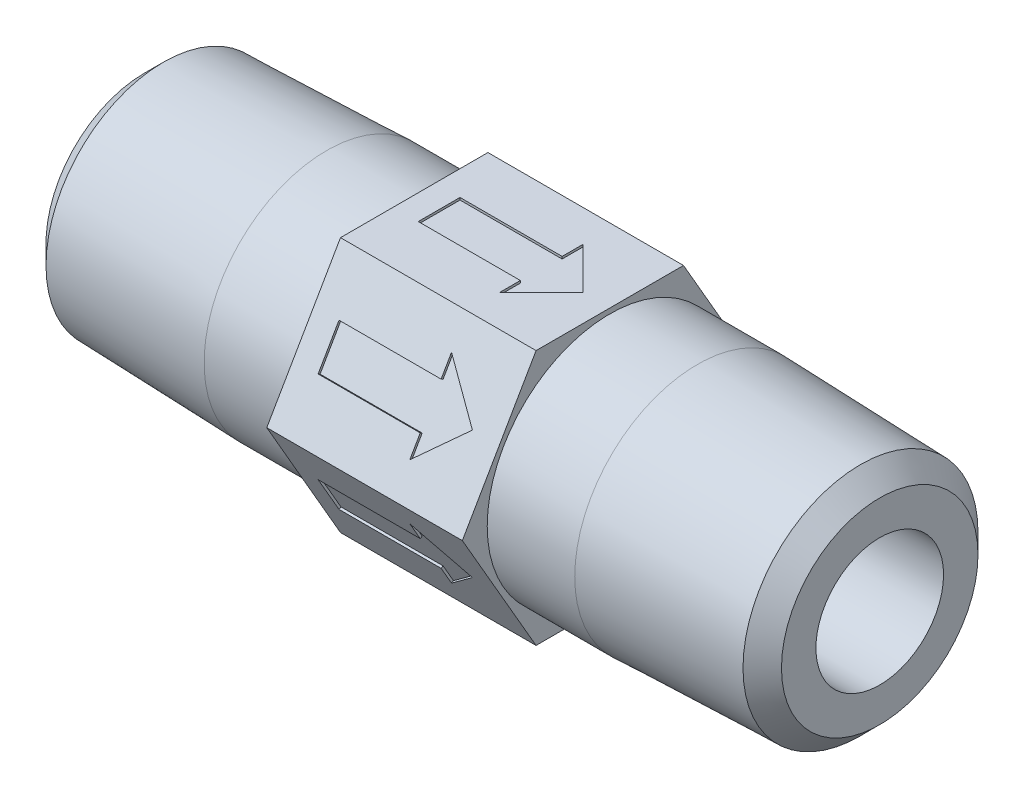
ISO-10303-21;
HEADER;
FILE_DESCRIPTION(('STEP AP214'),'2;1');
FILE_NAME('part.step','',(''),(''),'','','');
FILE_SCHEMA(('AUTOMOTIVE_DESIGN { 1 0 10303 214 1 1 1 1 }'));
ENDSEC;
DATA;
#1=APPLICATION_CONTEXT('core data for automotive mechanical design processes');
#2=APPLICATION_PROTOCOL_DEFINITION('international standard','automotive_design',2000,#1);
#3=PRODUCT_CONTEXT('',#1,'mechanical');
#4=PRODUCT('Part','Part','',(#3));
#5=PRODUCT_RELATED_PRODUCT_CATEGORY('part','',(#4));
#6=PRODUCT_DEFINITION_FORMATION('','',#4);
#7=PRODUCT_DEFINITION_CONTEXT('part definition',#1,'design');
#8=PRODUCT_DEFINITION('design','',#6,#7);
#9=PRODUCT_DEFINITION_SHAPE('','',#8);
#10=(LENGTH_UNIT() NAMED_UNIT(*) SI_UNIT(.MILLI.,.METRE.));
#11=(NAMED_UNIT(*) PLANE_ANGLE_UNIT() SI_UNIT($,.RADIAN.));
#12=(NAMED_UNIT(*) SI_UNIT($,.STERADIAN.) SOLID_ANGLE_UNIT());
#13=UNCERTAINTY_MEASURE_WITH_UNIT(LENGTH_MEASURE(1.E-05),#10,'distance_accuracy_value','');
#14=(GEOMETRIC_REPRESENTATION_CONTEXT(3) GLOBAL_UNCERTAINTY_ASSIGNED_CONTEXT((#13)) GLOBAL_UNIT_ASSIGNED_CONTEXT((#10,
#11,#12)) REPRESENTATION_CONTEXT('',''));
#15=CARTESIAN_POINT('',(0.,0.,0.));
#16=DIRECTION('',(0.,0.,1.));
#17=DIRECTION('',(1.,0.,0.));
#18=AXIS2_PLACEMENT_3D('',#15,#16,#17);
#19=CARTESIAN_POINT('',(15.10284,0.,0.));
#20=DIRECTION('',(1.,0.,0.));
#21=DIRECTION('',(0.,1.,0.));
#22=AXIS2_PLACEMENT_3D('',#19,#20,#21);
#23=PLANE('',#22);
#24=CARTESIAN_POINT('',(15.10284,0.,0.));
#25=DIRECTION('',(-1.,0.,0.));
#26=DIRECTION('',(0.,0.,1.));
#27=AXIS2_PLACEMENT_3D('',#24,#25,#26);
#28=CIRCLE('',#27,3.571875);
#29=CARTESIAN_POINT('',(15.10284,0.,3.571875));
#30=VERTEX_POINT('',#29);
#31=EDGE_CURVE('E41',#30,#30,#28,.T.);
#32=ORIENTED_EDGE('',*,*,#31,.T.);
#33=EDGE_LOOP('',(#32));
#34=FACE_BOUND('',#33,.T.);
#35=ADVANCED_FACE('F38',(#34),#23,.F.);
#36=CARTESIAN_POINT('',(7.55142,0.,0.));
#37=DIRECTION('',(-1.,0.,0.));
#38=DIRECTION('',(0.,0.,1.));
#39=AXIS2_PLACEMENT_3D('',#36,#37,#38);
#40=CYLINDRICAL_SURFACE('',#39,3.571875);
#41=CARTESIAN_POINT('',(0.,0.,0.));
#42=DIRECTION('',(-1.,0.,0.));
#43=DIRECTION('',(0.,0.,1.));
#44=AXIS2_PLACEMENT_3D('',#41,#42,#43);
#45=CIRCLE('',#44,3.571875);
#46=CARTESIAN_POINT('',(0.,0.,3.571875));
#47=VERTEX_POINT('',#46);
#48=EDGE_CURVE('E767',#47,#47,#45,.F.);
#49=ORIENTED_EDGE('',*,*,#48,.F.);
#50=EDGE_LOOP('',(#49));
#51=FACE_BOUND('',#50,.T.);
#52=ORIENTED_EDGE('',*,*,#31,.F.);
#53=EDGE_LOOP('',(#52));
#54=FACE_BOUND('',#53,.T.);
#55=ADVANCED_FACE('F775',(#51,#54),#40,.F.);
#56=CARTESIAN_POINT('',(0.,0.,-3.27012197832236));
#57=DIRECTION('',(-1.,0.,0.));
#58=DIRECTION('',(0.,-1.,0.));
#59=AXIS2_PLACEMENT_3D('',#56,#57,#58);
#60=PLANE('',#59);
#61=CARTESIAN_POINT('',(5.6844286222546E-11,0.,0.));
#62=DIRECTION('',(1.,0.,0.));
#63=DIRECTION('',(0.,1.,0.));
#64=AXIS2_PLACEMENT_3D('',#61,#62,#63);
#65=CIRCLE('',#64,5.4978300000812);
#66=CARTESIAN_POINT('',(5.68448966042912E-11,5.4978300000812,0.));
#67=VERTEX_POINT('',#66);
#68=EDGE_CURVE('E755',#67,#67,#65,.F.);
#69=ORIENTED_EDGE('',*,*,#68,.T.);
#70=EDGE_LOOP('',(#69));
#71=FACE_BOUND('',#70,.T.);
#72=ORIENTED_EDGE('',*,*,#48,.T.);
#73=EDGE_LOOP('',(#72));
#74=FACE_BOUND('',#73,.T.);
#75=ADVANCED_FACE('F777',(#71,#74),#60,.T.);
#76=CARTESIAN_POINT('',(-5.68428084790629E-11,0.,0.));
#77=DIRECTION('',(1.,0.,0.));
#78=DIRECTION('',(0.,1.,0.));
#79=AXIS2_PLACEMENT_3D('',#76,#77,#78);
#80=CONICAL_SURFACE('',#79,5.49782999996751,0.785398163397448);
#81=ORIENTED_EDGE('',*,*,#68,.F.);
#82=EDGE_LOOP('',(#81));
#83=FACE_BOUND('',#82,.T.);
#84=CARTESIAN_POINT('',(1.07591259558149,0.,0.));
#85=DIRECTION('',(1.,0.,0.));
#86=DIRECTION('',(0.,0.,-1.));
#87=AXIS2_PLACEMENT_3D('',#84,#85,#86);
#88=CIRCLE('',#87,6.57374259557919);
#89=CARTESIAN_POINT('',(1.07591259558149,0.,-6.57374259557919));
#90=VERTEX_POINT('',#89);
#91=EDGE_CURVE('E752',#90,#90,#88,.T.);
#92=ORIENTED_EDGE('',*,*,#91,.F.);
#93=EDGE_LOOP('',(#92));
#94=FACE_BOUND('',#93,.T.);
#95=ADVANCED_FACE('F782',(#83,#94),#80,.T.);
#96=CARTESIAN_POINT('',(10.2057199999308,0.,0.));
#97=DIRECTION('',(1.,0.,0.));
#98=DIRECTION('',(0.,1.,0.));
#99=AXIS2_PLACEMENT_3D('',#96,#97,#98);
#100=CONICAL_SURFACE('',#99,6.85799999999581,0.0311250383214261);
#101=ORIENTED_EDGE('',*,*,#91,.T.);
#102=EDGE_LOOP('',(#101));
#103=FACE_BOUND('',#102,.T.);
#104=CARTESIAN_POINT('',(10.20572,0.,0.));
#105=DIRECTION('',(1.,0.,0.));
#106=DIRECTION('',(0.,0.,-1.));
#107=AXIS2_PLACEMENT_3D('',#104,#105,#106);
#108=CIRCLE('',#107,6.858);
#109=CARTESIAN_POINT('',(10.20572,0.,-6.858));
#110=VERTEX_POINT('',#109);
#111=EDGE_CURVE('E748',#110,#110,#108,.T.);
#112=ORIENTED_EDGE('',*,*,#111,.F.);
#113=EDGE_LOOP('',(#112));
#114=FACE_BOUND('',#113,.T.);
#115=ADVANCED_FACE('F854',(#103,#114),#100,.T.);
#116=CARTESIAN_POINT('',(12.65428,0.,0.));
#117=DIRECTION('',(1.,0.,0.));
#118=DIRECTION('',(0.,0.,-1.));
#119=AXIS2_PLACEMENT_3D('',#116,#117,#118);
#120=CYLINDRICAL_SURFACE('',#119,6.858);
#121=ORIENTED_EDGE('',*,*,#111,.T.);
#122=EDGE_LOOP('',(#121));
#123=FACE_BOUND('',#122,.T.);
#124=CARTESIAN_POINT('',(15.10284,0.,0.));
#125=DIRECTION('',(1.,0.,0.));
#126=DIRECTION('',(0.,0.,-1.));
#127=AXIS2_PLACEMENT_3D('',#124,#125,#126);
#128=CIRCLE('',#127,6.858);
#129=CARTESIAN_POINT('',(15.10284,0.,-6.858));
#130=VERTEX_POINT('',#129);
#131=EDGE_CURVE('E751',#130,#130,#128,.F.);
#132=ORIENTED_EDGE('',*,*,#131,.T.);
#133=EDGE_LOOP('',(#132));
#134=FACE_BOUND('',#133,.T.);
#135=ADVANCED_FACE('F850',(#123,#134),#120,.T.);
#136=CARTESIAN_POINT('',(26.04516,0.,0.));
#137=DIRECTION('',(1.,0.,0.));
#138=DIRECTION('',(0.,1.,0.));
#139=AXIS2_PLACEMENT_3D('',#136,#137,#138);
#140=PLANE('',#139);
#141=CARTESIAN_POINT('',(26.04516,0.,0.));
#142=DIRECTION('',(1.,0.,0.));
#143=DIRECTION('',(0.,0.,-1.));
#144=AXIS2_PLACEMENT_3D('',#141,#142,#143);
#145=CIRCLE('',#144,3.571875);
#146=CARTESIAN_POINT('',(26.04516,0.,-3.571875));
#147=VERTEX_POINT('',#146);
#148=EDGE_CURVE('E747',#147,#147,#145,.T.);
#149=ORIENTED_EDGE('',*,*,#148,.T.);
#150=EDGE_LOOP('',(#149));
#151=FACE_BOUND('',#150,.T.);
#152=ADVANCED_FACE('F846',(#151),#140,.T.);
#153=CARTESIAN_POINT('',(15.10284,0.,0.));
#154=DIRECTION('',(1.,0.,0.));
#155=DIRECTION('',(0.,1.,0.));
#156=AXIS2_PLACEMENT_3D('',#153,#154,#155);
#157=PLANE('',#156);
#158=ORIENTED_EDGE('',*,*,#131,.F.);
#159=EDGE_LOOP('',(#158));
#160=FACE_BOUND('',#159,.T.);
#161=DIRECTION('',(0.,0.,-1.));
#162=VECTOR('',#161,1.);
#163=CARTESIAN_POINT('',(15.10284,-7.14375,-4.12444598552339));
#164=LINE('',#163,#162);
#165=CARTESIAN_POINT('',(15.10284,-7.14375,4.12444598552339));
#166=VERTEX_POINT('',#165);
#167=CARTESIAN_POINT('',(15.10284,-7.14375,-4.12444598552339));
#168=VERTEX_POINT('',#167);
#169=EDGE_CURVE('E744',#166,#168,#164,.T.);
#170=ORIENTED_EDGE('',*,*,#169,.F.);
#171=DIRECTION('',(0.,-0.866025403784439,-0.5));
#172=VECTOR('',#171,1.);
#173=CARTESIAN_POINT('',(15.10284,-7.14375,4.12444598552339));
#174=LINE('',#173,#172);
#175=CARTESIAN_POINT('',(15.10284,0.,8.24889197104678));
#176=VERTEX_POINT('',#175);
#177=EDGE_CURVE('E717',#176,#166,#174,.T.);
#178=ORIENTED_EDGE('',*,*,#177,.F.);
#179=DIRECTION('',(0.,-0.866025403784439,0.5));
#180=VECTOR('',#179,1.);
#181=CARTESIAN_POINT('',(15.10284,0.,8.24889197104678));
#182=LINE('',#181,#180);
#183=CARTESIAN_POINT('',(15.10284,7.14375,4.12444598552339));
#184=VERTEX_POINT('',#183);
#185=EDGE_CURVE('E723',#184,#176,#182,.T.);
#186=ORIENTED_EDGE('',*,*,#185,.F.);
#187=DIRECTION('',(0.,0.,1.));
#188=VECTOR('',#187,1.);
#189=CARTESIAN_POINT('',(15.10284,7.14375,4.12444598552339));
#190=LINE('',#189,#188);
#191=CARTESIAN_POINT('',(15.10284,7.14375,-4.1244459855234));
#192=VERTEX_POINT('',#191);
#193=EDGE_CURVE('E729',#192,#184,#190,.T.);
#194=ORIENTED_EDGE('',*,*,#193,.F.);
#195=DIRECTION('',(0.,0.866025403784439,0.5));
#196=VECTOR('',#195,1.);
#197=CARTESIAN_POINT('',(15.10284,7.14375,-4.1244459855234));
#198=LINE('',#197,#196);
#199=CARTESIAN_POINT('',(15.10284,0.,-8.24889197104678));
#200=VERTEX_POINT('',#199);
#201=EDGE_CURVE('E735',#200,#192,#198,.T.);
#202=ORIENTED_EDGE('',*,*,#201,.F.);
#203=DIRECTION('',(0.,0.866025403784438,-0.500000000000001));
#204=VECTOR('',#203,1.);
#205=CARTESIAN_POINT('',(15.10284,0.,-8.24889197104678));
#206=LINE('',#205,#204);
#207=EDGE_CURVE('E741',#168,#200,#206,.T.);
#208=ORIENTED_EDGE('',*,*,#207,.F.);
#209=EDGE_LOOP('',(#170,#178,#186,#194,#202,#208));
#210=FACE_BOUND('',#209,.T.);
#211=ADVANCED_FACE('F842',(#160,#210),#157,.F.);
#212=CARTESIAN_POINT('',(33.59658,0.,0.));
#213=DIRECTION('',(1.,0.,0.));
#214=DIRECTION('',(0.,0.,-1.));
#215=AXIS2_PLACEMENT_3D('',#212,#213,#214);
#216=CYLINDRICAL_SURFACE('',#215,3.571875);
#217=CARTESIAN_POINT('',(41.148,0.,0.));
#218=DIRECTION('',(1.,0.,0.));
#219=DIRECTION('',(0.,0.,-1.));
#220=AXIS2_PLACEMENT_3D('',#217,#218,#219);
#221=CIRCLE('',#220,3.571875);
#222=CARTESIAN_POINT('',(41.148,0.,-3.571875));
#223=VERTEX_POINT('',#222);
#224=EDGE_CURVE('E704',#223,#223,#221,.F.);
#225=ORIENTED_EDGE('',*,*,#224,.F.);
#226=EDGE_LOOP('',(#225));
#227=FACE_BOUND('',#226,.T.);
#228=ORIENTED_EDGE('',*,*,#148,.F.);
#229=EDGE_LOOP('',(#228));
#230=FACE_BOUND('',#229,.T.);
#231=ADVANCED_FACE('F838',(#227,#230),#216,.F.);
#232=CARTESIAN_POINT('',(15.10284,-7.14375,-4.12444598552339));
#233=DIRECTION('',(0.,-1.,0.));
#234=DIRECTION('',(0.,0.,-1.));
#235=AXIS2_PLACEMENT_3D('',#232,#233,#234);
#236=PLANE('',#235);
#237=DIRECTION('',(0.707106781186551,0.,0.707106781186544));
#238=VECTOR('',#237,1.);
#239=CARTESIAN_POINT('',(24.5451700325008,-7.14375,0.));
#240=LINE('',#239,#238);
#241=CARTESIAN_POINT('',(22.209963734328,-7.14375000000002,-2.33520629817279));
#242=VERTEX_POINT('',#241);
#243=CARTESIAN_POINT('',(24.5451700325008,-7.14375,0.));
#244=VERTEX_POINT('',#243);
#245=EDGE_CURVE('E54',#242,#244,#240,.T.);
#246=ORIENTED_EDGE('',*,*,#245,.F.);
#247=DIRECTION('',(0.,0.,-1.));
#248=VECTOR('',#247,1.);
#249=CARTESIAN_POINT('',(22.209963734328,-7.14375000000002,-2.33520629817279));
#250=LINE('',#249,#248);
#251=CARTESIAN_POINT('',(22.209963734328,-7.14375000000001,-1.16760314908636));
#252=VERTEX_POINT('',#251);
#253=EDGE_CURVE('E470',#252,#242,#250,.T.);
#254=ORIENTED_EDGE('',*,*,#253,.F.);
#255=DIRECTION('',(1.,0.,0.));
#256=VECTOR('',#255,1.);
#257=CARTESIAN_POINT('',(22.209963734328,-7.14375000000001,-1.16760314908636));
#258=LINE('',#257,#256);
#259=CARTESIAN_POINT('',(16.4972839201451,-7.14375000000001,-1.16760314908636));
#260=VERTEX_POINT('',#259);
#261=EDGE_CURVE('E503',#260,#252,#258,.T.);
#262=ORIENTED_EDGE('',*,*,#261,.F.);
#263=DIRECTION('',(0.,0.,-1.));
#264=VECTOR('',#263,1.);
#265=CARTESIAN_POINT('',(16.4972839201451,-7.14374999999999,1.1676031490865));
#266=LINE('',#265,#264);
#267=CARTESIAN_POINT('',(16.4972839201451,-7.14374999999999,1.1676031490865));
#268=VERTEX_POINT('',#267);
#269=EDGE_CURVE('E500',#268,#260,#266,.T.);
#270=ORIENTED_EDGE('',*,*,#269,.F.);
#271=DIRECTION('',(-1.,0.,0.));
#272=VECTOR('',#271,1.);
#273=CARTESIAN_POINT('',(22.209963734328,-7.14374999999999,1.1676031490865));
#274=LINE('',#273,#272);
#275=CARTESIAN_POINT('',(22.209963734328,-7.14374999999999,1.1676031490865));
#276=VERTEX_POINT('',#275);
#277=EDGE_CURVE('E497',#276,#268,#274,.T.);
#278=ORIENTED_EDGE('',*,*,#277,.F.);
#279=DIRECTION('',(0.,0.,-1.));
#280=VECTOR('',#279,1.);
#281=CARTESIAN_POINT('',(22.209963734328,-7.14374999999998,2.33520629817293));
#282=LINE('',#281,#280);
#283=CARTESIAN_POINT('',(22.209963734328,-7.14374999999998,2.33520629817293));
#284=VERTEX_POINT('',#283);
#285=EDGE_CURVE('E494',#284,#276,#282,.T.);
#286=ORIENTED_EDGE('',*,*,#285,.F.);
#287=DIRECTION('',(-0.707106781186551,0.,0.707106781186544));
#288=VECTOR('',#287,1.);
#289=CARTESIAN_POINT('',(24.5451700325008,-7.14375,0.));
#290=LINE('',#289,#288);
#291=EDGE_CURVE('E490',#244,#284,#290,.T.);
#292=ORIENTED_EDGE('',*,*,#291,.F.);
#293=EDGE_LOOP('',(#246,#254,#262,#270,#278,#286,#292));
#294=FACE_BOUND('',#293,.T.);
#295=DIRECTION('',(0.,0.,1.));
#296=VECTOR('',#295,1.);
#297=CARTESIAN_POINT('',(26.04516,-7.14375,0.));
#298=LINE('',#297,#296);
#299=CARTESIAN_POINT('',(26.04516,-7.14375,4.12444598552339));
#300=VERTEX_POINT('',#299);
#301=CARTESIAN_POINT('',(26.04516,-7.14375,-4.12444598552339));
#302=VERTEX_POINT('',#301);
#303=EDGE_CURVE('E702',#300,#302,#298,.F.);
#304=ORIENTED_EDGE('',*,*,#303,.F.);
#305=DIRECTION('',(1.,0.,0.));
#306=VECTOR('',#305,1.);
#307=CARTESIAN_POINT('',(15.10284,-7.14375,4.12444598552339));
#308=LINE('',#307,#306);
#309=EDGE_CURVE('E714',#166,#300,#308,.T.);
#310=ORIENTED_EDGE('',*,*,#309,.F.);
#311=ORIENTED_EDGE('',*,*,#169,.T.);
#312=DIRECTION('',(1.,0.,0.));
#313=VECTOR('',#312,1.);
#314=CARTESIAN_POINT('',(15.10284,-7.14375,-4.12444598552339));
#315=LINE('',#314,#313);
#316=EDGE_CURVE('E738',#302,#168,#315,.F.);
#317=ORIENTED_EDGE('',*,*,#316,.F.);
#318=EDGE_LOOP('',(#304,#310,#311,#317));
#319=FACE_BOUND('',#318,.T.);
#320=ADVANCED_FACE('F835',(#294,#319),#236,.T.);
#321=CARTESIAN_POINT('',(15.10284,0.,-8.24889197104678));
#322=DIRECTION('',(0.,-0.500000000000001,-0.866025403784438));
#323=DIRECTION('',(0.,0.866025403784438,-0.500000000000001));
#324=AXIS2_PLACEMENT_3D('',#321,#322,#323);
#325=PLANE('',#324);
#326=DIRECTION('',(0.707106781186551,-0.612372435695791,0.353553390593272));
#327=VECTOR('',#326,1.);
#328=CARTESIAN_POINT('',(24.5451700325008,-3.571875,-6.18666897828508));
#329=LINE('',#328,#327);
#330=CARTESIAN_POINT('',(22.209963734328,-1.54952702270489,-7.35427212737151));
#331=VERTEX_POINT('',#330);
#332=CARTESIAN_POINT('',(24.5451700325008,-3.571875,-6.18666897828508));
#333=VERTEX_POINT('',#332);
#334=EDGE_CURVE('E62',#331,#333,#329,.T.);
#335=ORIENTED_EDGE('',*,*,#334,.F.);
#336=DIRECTION('',(0.,0.866025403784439,-0.5));
#337=VECTOR('',#336,1.);
#338=CARTESIAN_POINT('',(22.209963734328,-1.54952702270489,-7.35427212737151));
#339=LINE('',#338,#337);
#340=CARTESIAN_POINT('',(22.209963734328,-2.56070101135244,-6.7704705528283));
#341=VERTEX_POINT('',#340);
#342=EDGE_CURVE('E416',#341,#331,#339,.T.);
#343=ORIENTED_EDGE('',*,*,#342,.F.);
#344=DIRECTION('',(1.,0.,0.));
#345=VECTOR('',#344,1.);
#346=CARTESIAN_POINT('',(22.209963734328,-2.56070101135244,-6.7704705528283));
#347=LINE('',#346,#345);
#348=CARTESIAN_POINT('',(16.4972839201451,-2.56070101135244,-6.7704705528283));
#349=VERTEX_POINT('',#348);
#350=EDGE_CURVE('E449',#349,#341,#347,.T.);
#351=ORIENTED_EDGE('',*,*,#350,.F.);
#352=DIRECTION('',(0.,0.866025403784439,-0.5));
#353=VECTOR('',#352,1.);
#354=CARTESIAN_POINT('',(16.4972839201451,-4.58304898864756,-5.60286740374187));
#355=LINE('',#354,#353);
#356=CARTESIAN_POINT('',(16.4972839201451,-4.58304898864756,-5.60286740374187));
#357=VERTEX_POINT('',#356);
#358=EDGE_CURVE('E446',#357,#349,#355,.T.);
#359=ORIENTED_EDGE('',*,*,#358,.F.);
#360=DIRECTION('',(-1.,0.,0.));
#361=VECTOR('',#360,1.);
#362=CARTESIAN_POINT('',(22.209963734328,-4.58304898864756,-5.60286740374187));
#363=LINE('',#362,#361);
#364=CARTESIAN_POINT('',(22.209963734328,-4.58304898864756,-5.60286740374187));
#365=VERTEX_POINT('',#364);
#366=EDGE_CURVE('E443',#365,#357,#363,.T.);
#367=ORIENTED_EDGE('',*,*,#366,.F.);
#368=DIRECTION('',(0.,0.866025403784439,-0.5));
#369=VECTOR('',#368,1.);
#370=CARTESIAN_POINT('',(22.209963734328,-5.59422297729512,-5.01906582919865));
#371=LINE('',#370,#369);
#372=CARTESIAN_POINT('',(22.209963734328,-5.59422297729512,-5.01906582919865));
#373=VERTEX_POINT('',#372);
#374=EDGE_CURVE('E440',#373,#365,#371,.T.);
#375=ORIENTED_EDGE('',*,*,#374,.F.);
#376=DIRECTION('',(-0.707106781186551,-0.612372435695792,0.353553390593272));
#377=VECTOR('',#376,1.);
#378=CARTESIAN_POINT('',(24.5451700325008,-3.571875,-6.18666897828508));
#379=LINE('',#378,#377);
#380=EDGE_CURVE('E436',#333,#373,#379,.T.);
#381=ORIENTED_EDGE('',*,*,#380,.F.);
#382=EDGE_LOOP('',(#335,#343,#351,#359,#367,#375,#381));
#383=FACE_BOUND('',#382,.T.);
#384=DIRECTION('',(0.,0.866025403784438,-0.500000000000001));
#385=VECTOR('',#384,1.);
#386=CARTESIAN_POINT('',(26.04516,-7.14375,-4.12444598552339));
#387=LINE('',#386,#385);
#388=CARTESIAN_POINT('',(26.04516,0.,-8.24889197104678));
#389=VERTEX_POINT('',#388);
#390=EDGE_CURVE('E699',#302,#389,#387,.T.);
#391=ORIENTED_EDGE('',*,*,#390,.F.);
#392=ORIENTED_EDGE('',*,*,#316,.T.);
#393=ORIENTED_EDGE('',*,*,#207,.T.);
#394=DIRECTION('',(1.,0.,0.));
#395=VECTOR('',#394,1.);
#396=CARTESIAN_POINT('',(15.10284,0.,-8.24889197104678));
#397=LINE('',#396,#395);
#398=EDGE_CURVE('E732',#389,#200,#397,.F.);
#399=ORIENTED_EDGE('',*,*,#398,.F.);
#400=EDGE_LOOP('',(#391,#392,#393,#399));
#401=FACE_BOUND('',#400,.T.);
#402=ADVANCED_FACE('F831',(#383,#401),#325,.T.);
#403=CARTESIAN_POINT('',(15.10284,7.14375,-4.1244459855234));
#404=DIRECTION('',(0.,0.5,-0.866025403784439));
#405=DIRECTION('',(0.,0.866025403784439,0.5));
#406=AXIS2_PLACEMENT_3D('',#403,#404,#405);
#407=PLANE('',#406);
#408=DIRECTION('',(0.707106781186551,-0.612372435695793,-0.353553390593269));
#409=VECTOR('',#408,1.);
#410=CARTESIAN_POINT('',(24.5451700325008,3.57187499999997,-6.1866689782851));
#411=LINE('',#410,#409);
#412=CARTESIAN_POINT('',(22.209963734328,5.59422297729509,-5.01906582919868));
#413=VERTEX_POINT('',#412);
#414=CARTESIAN_POINT('',(24.5451700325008,3.57187499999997,-6.1866689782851));
#415=VERTEX_POINT('',#414);
#416=EDGE_CURVE('E351',#413,#415,#411,.T.);
#417=ORIENTED_EDGE('',*,*,#416,.F.);
#418=DIRECTION('',(0.,0.866025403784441,0.499999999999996));
#419=VECTOR('',#418,1.);
#420=CARTESIAN_POINT('',(22.209963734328,5.59422297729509,-5.01906582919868));
#421=LINE('',#420,#419);
#422=CARTESIAN_POINT('',(22.209963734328,4.58304898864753,-5.60286740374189));
#423=VERTEX_POINT('',#422);
#424=EDGE_CURVE('E369',#423,#413,#421,.T.);
#425=ORIENTED_EDGE('',*,*,#424,.F.);
#426=DIRECTION('',(1.,0.,0.));
#427=VECTOR('',#426,1.);
#428=CARTESIAN_POINT('',(22.209963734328,4.58304898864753,-5.60286740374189));
#429=LINE('',#428,#427);
#430=CARTESIAN_POINT('',(16.4972839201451,4.58304898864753,-5.60286740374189));
#431=VERTEX_POINT('',#430);
#432=EDGE_CURVE('E372',#431,#423,#429,.T.);
#433=ORIENTED_EDGE('',*,*,#432,.F.);
#434=DIRECTION('',(0.,0.866025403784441,0.499999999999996));
#435=VECTOR('',#434,1.);
#436=CARTESIAN_POINT('',(16.4972839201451,2.56070101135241,-6.77047055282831));
#437=LINE('',#436,#435);
#438=CARTESIAN_POINT('',(16.4972839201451,2.56070101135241,-6.77047055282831));
#439=VERTEX_POINT('',#438);
#440=EDGE_CURVE('E395',#439,#431,#437,.T.);
#441=ORIENTED_EDGE('',*,*,#440,.F.);
#442=DIRECTION('',(-1.,0.,0.));
#443=VECTOR('',#442,1.);
#444=CARTESIAN_POINT('',(22.209963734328,2.56070101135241,-6.77047055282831));
#445=LINE('',#444,#443);
#446=CARTESIAN_POINT('',(22.209963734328,2.56070101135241,-6.77047055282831));
#447=VERTEX_POINT('',#446);
#448=EDGE_CURVE('E392',#447,#439,#445,.T.);
#449=ORIENTED_EDGE('',*,*,#448,.F.);
#450=DIRECTION('',(0.,0.866025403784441,0.499999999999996));
#451=VECTOR('',#450,1.);
#452=CARTESIAN_POINT('',(22.209963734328,1.54952702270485,-7.35427212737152));
#453=LINE('',#452,#451);
#454=CARTESIAN_POINT('',(22.209963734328,1.54952702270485,-7.35427212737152));
#455=VERTEX_POINT('',#454);
#456=EDGE_CURVE('E389',#455,#447,#453,.T.);
#457=ORIENTED_EDGE('',*,*,#456,.F.);
#458=DIRECTION('',(-0.707106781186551,-0.612372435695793,-0.353553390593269));
#459=VECTOR('',#458,1.);
#460=CARTESIAN_POINT('',(24.5451700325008,3.57187499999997,-6.1866689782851));
#461=LINE('',#460,#459);
#462=EDGE_CURVE('E386',#415,#455,#461,.T.);
#463=ORIENTED_EDGE('',*,*,#462,.F.);
#464=EDGE_LOOP('',(#417,#425,#433,#441,#449,#457,#463));
#465=FACE_BOUND('',#464,.T.);
#466=DIRECTION('',(0.,0.866025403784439,0.5));
#467=VECTOR('',#466,1.);
#468=CARTESIAN_POINT('',(26.04516,0.,-8.24889197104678));
#469=LINE('',#468,#467);
#470=CARTESIAN_POINT('',(26.04516,7.14375,-4.1244459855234));
#471=VERTEX_POINT('',#470);
#472=EDGE_CURVE('E696',#389,#471,#469,.T.);
#473=ORIENTED_EDGE('',*,*,#472,.F.);
#474=ORIENTED_EDGE('',*,*,#398,.T.);
#475=ORIENTED_EDGE('',*,*,#201,.T.);
#476=DIRECTION('',(1.,0.,0.));
#477=VECTOR('',#476,1.);
#478=CARTESIAN_POINT('',(15.10284,7.14375,-4.1244459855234));
#479=LINE('',#478,#477);
#480=EDGE_CURVE('E726',#471,#192,#479,.F.);
#481=ORIENTED_EDGE('',*,*,#480,.F.);
#482=EDGE_LOOP('',(#473,#474,#475,#481));
#483=FACE_BOUND('',#482,.T.);
#484=ADVANCED_FACE('F827',(#465,#483),#407,.T.);
#485=CARTESIAN_POINT('',(15.10284,7.14375,4.12444598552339));
#486=DIRECTION('',(0.,1.,0.));
#487=DIRECTION('',(0.,0.,1.));
#488=AXIS2_PLACEMENT_3D('',#485,#486,#487);
#489=PLANE('',#488);
#490=DIRECTION('',(0.707106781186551,0.,-0.707106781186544));
#491=VECTOR('',#490,1.);
#492=CARTESIAN_POINT('',(24.5451700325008,7.14375,0.));
#493=LINE('',#492,#491);
#494=CARTESIAN_POINT('',(22.209963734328,7.14375000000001,2.33520629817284));
#495=VERTEX_POINT('',#494);
#496=CARTESIAN_POINT('',(24.5451700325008,7.14375,0.));
#497=VERTEX_POINT('',#496);
#498=EDGE_CURVE('E402',#495,#497,#493,.T.);
#499=ORIENTED_EDGE('',*,*,#498,.F.);
#500=DIRECTION('',(0.,0.,1.));
#501=VECTOR('',#500,1.);
#502=CARTESIAN_POINT('',(22.209963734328,7.14375000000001,2.33520629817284));
#503=LINE('',#502,#501);
#504=CARTESIAN_POINT('',(22.209963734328,7.14375,1.16760314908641));
#505=VERTEX_POINT('',#504);
#506=EDGE_CURVE('E579',#505,#495,#503,.T.);
#507=ORIENTED_EDGE('',*,*,#506,.F.);
#508=DIRECTION('',(1.,0.,0.));
#509=VECTOR('',#508,1.);
#510=CARTESIAN_POINT('',(22.209963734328,7.14375,1.16760314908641));
#511=LINE('',#510,#509);
#512=CARTESIAN_POINT('',(16.4972839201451,7.14375,1.16760314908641));
#513=VERTEX_POINT('',#512);
#514=EDGE_CURVE('E611',#513,#505,#511,.T.);
#515=ORIENTED_EDGE('',*,*,#514,.F.);
#516=DIRECTION('',(0.,0.,1.));
#517=VECTOR('',#516,1.);
#518=CARTESIAN_POINT('',(16.4972839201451,7.14375,-1.16760314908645));
#519=LINE('',#518,#517);
#520=CARTESIAN_POINT('',(16.4972839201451,7.14375,-1.16760314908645));
#521=VERTEX_POINT('',#520);
#522=EDGE_CURVE('E608',#521,#513,#519,.T.);
#523=ORIENTED_EDGE('',*,*,#522,.F.);
#524=DIRECTION('',(-1.,0.,0.));
#525=VECTOR('',#524,1.);
#526=CARTESIAN_POINT('',(22.209963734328,7.14375,-1.16760314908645));
#527=LINE('',#526,#525);
#528=CARTESIAN_POINT('',(22.209963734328,7.14375,-1.16760314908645));
#529=VERTEX_POINT('',#528);
#530=EDGE_CURVE('E605',#529,#521,#527,.T.);
#531=ORIENTED_EDGE('',*,*,#530,.F.);
#532=DIRECTION('',(0.,0.,1.));
#533=VECTOR('',#532,1.);
#534=CARTESIAN_POINT('',(22.209963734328,7.14374999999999,-2.33520629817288));
#535=LINE('',#534,#533);
#536=CARTESIAN_POINT('',(22.209963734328,7.14374999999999,-2.33520629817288));
#537=VERTEX_POINT('',#536);
#538=EDGE_CURVE('E602',#537,#529,#535,.T.);
#539=ORIENTED_EDGE('',*,*,#538,.F.);
#540=DIRECTION('',(-0.707106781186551,0.,-0.707106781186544));
#541=VECTOR('',#540,1.);
#542=CARTESIAN_POINT('',(24.5451700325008,7.14375,0.));
#543=LINE('',#542,#541);
#544=EDGE_CURVE('E599',#497,#537,#543,.T.);
#545=ORIENTED_EDGE('',*,*,#544,.F.);
#546=EDGE_LOOP('',(#499,#507,#515,#523,#531,#539,#545));
#547=FACE_BOUND('',#546,.T.);
#548=DIRECTION('',(0.,0.,1.));
#549=VECTOR('',#548,1.);
#550=CARTESIAN_POINT('',(26.04516,7.14374999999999,0.));
#551=LINE('',#550,#549);
#552=CARTESIAN_POINT('',(26.04516,7.14375,4.12444598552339));
#553=VERTEX_POINT('',#552);
#554=EDGE_CURVE('E693',#471,#553,#551,.T.);
#555=ORIENTED_EDGE('',*,*,#554,.F.);
#556=ORIENTED_EDGE('',*,*,#480,.T.);
#557=ORIENTED_EDGE('',*,*,#193,.T.);
#558=DIRECTION('',(1.,0.,0.));
#559=VECTOR('',#558,1.);
#560=CARTESIAN_POINT('',(15.10284,7.14375,4.12444598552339));
#561=LINE('',#560,#559);
#562=EDGE_CURVE('E720',#553,#184,#561,.F.);
#563=ORIENTED_EDGE('',*,*,#562,.F.);
#564=EDGE_LOOP('',(#555,#556,#557,#563));
#565=FACE_BOUND('',#564,.T.);
#566=ADVANCED_FACE('F823',(#547,#565),#489,.T.);
#567=CARTESIAN_POINT('',(15.10284,0.,8.24889197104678));
#568=DIRECTION('',(0.,0.5,0.866025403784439));
#569=DIRECTION('',(0.,-0.866025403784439,0.5));
#570=AXIS2_PLACEMENT_3D('',#567,#568,#569);
#571=PLANE('',#570);
#572=DIRECTION('',(0.707106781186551,0.612372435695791,-0.353553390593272));
#573=VECTOR('',#572,1.);
#574=CARTESIAN_POINT('',(24.5451700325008,3.571875,6.18666897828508));
#575=LINE('',#574,#573);
#576=CARTESIAN_POINT('',(22.209963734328,1.54952702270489,7.35427212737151));
#577=VERTEX_POINT('',#576);
#578=CARTESIAN_POINT('',(24.5451700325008,3.571875,6.18666897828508));
#579=VERTEX_POINT('',#578);
#580=EDGE_CURVE('E618',#577,#579,#575,.T.);
#581=ORIENTED_EDGE('',*,*,#580,.F.);
#582=DIRECTION('',(0.,-0.866025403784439,0.5));
#583=VECTOR('',#582,1.);
#584=CARTESIAN_POINT('',(22.209963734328,1.54952702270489,7.35427212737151));
#585=LINE('',#584,#583);
#586=CARTESIAN_POINT('',(22.209963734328,2.56070101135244,6.7704705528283));
#587=VERTEX_POINT('',#586);
#588=EDGE_CURVE('E635',#587,#577,#585,.T.);
#589=ORIENTED_EDGE('',*,*,#588,.F.);
#590=DIRECTION('',(1.,0.,0.));
#591=VECTOR('',#590,1.);
#592=CARTESIAN_POINT('',(22.209963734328,2.56070101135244,6.7704705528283));
#593=LINE('',#592,#591);
#594=CARTESIAN_POINT('',(16.4972839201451,2.56070101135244,6.7704705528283));
#595=VERTEX_POINT('',#594);
#596=EDGE_CURVE('E667',#595,#587,#593,.T.);
#597=ORIENTED_EDGE('',*,*,#596,.F.);
#598=DIRECTION('',(0.,-0.866025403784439,0.5));
#599=VECTOR('',#598,1.);
#600=CARTESIAN_POINT('',(16.4972839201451,4.58304898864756,5.60286740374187));
#601=LINE('',#600,#599);
#602=CARTESIAN_POINT('',(16.4972839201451,4.58304898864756,5.60286740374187));
#603=VERTEX_POINT('',#602);
#604=EDGE_CURVE('E664',#603,#595,#601,.T.);
#605=ORIENTED_EDGE('',*,*,#604,.F.);
#606=DIRECTION('',(-1.,0.,0.));
#607=VECTOR('',#606,1.);
#608=CARTESIAN_POINT('',(22.209963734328,4.58304898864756,5.60286740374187));
#609=LINE('',#608,#607);
#610=CARTESIAN_POINT('',(22.209963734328,4.58304898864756,5.60286740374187));
#611=VERTEX_POINT('',#610);
#612=EDGE_CURVE('E661',#611,#603,#609,.T.);
#613=ORIENTED_EDGE('',*,*,#612,.F.);
#614=DIRECTION('',(0.,-0.866025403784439,0.5));
#615=VECTOR('',#614,1.);
#616=CARTESIAN_POINT('',(22.209963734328,5.59422297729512,5.01906582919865));
#617=LINE('',#616,#615);
#618=CARTESIAN_POINT('',(22.209963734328,5.59422297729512,5.01906582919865));
#619=VERTEX_POINT('',#618);
#620=EDGE_CURVE('E658',#619,#611,#617,.T.);
#621=ORIENTED_EDGE('',*,*,#620,.F.);
#622=DIRECTION('',(-0.707106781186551,0.612372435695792,-0.353553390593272));
#623=VECTOR('',#622,1.);
#624=CARTESIAN_POINT('',(24.5451700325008,3.571875,6.18666897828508));
#625=LINE('',#624,#623);
#626=EDGE_CURVE('E655',#579,#619,#625,.T.);
#627=ORIENTED_EDGE('',*,*,#626,.F.);
#628=EDGE_LOOP('',(#581,#589,#597,#605,#613,#621,#627));
#629=FACE_BOUND('',#628,.T.);
#630=DIRECTION('',(0.,-0.866025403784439,0.5));
#631=VECTOR('',#630,1.);
#632=CARTESIAN_POINT('',(26.04516,7.14375,4.12444598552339));
#633=LINE('',#632,#631);
#634=CARTESIAN_POINT('',(26.04516,0.,8.24889197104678));
#635=VERTEX_POINT('',#634);
#636=EDGE_CURVE('E690',#553,#635,#633,.T.);
#637=ORIENTED_EDGE('',*,*,#636,.F.);
#638=ORIENTED_EDGE('',*,*,#562,.T.);
#639=ORIENTED_EDGE('',*,*,#185,.T.);
#640=DIRECTION('',(1.,0.,0.));
#641=VECTOR('',#640,1.);
#642=CARTESIAN_POINT('',(15.10284,0.,8.24889197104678));
#643=LINE('',#642,#641);
#644=EDGE_CURVE('E711',#635,#176,#643,.F.);
#645=ORIENTED_EDGE('',*,*,#644,.F.);
#646=EDGE_LOOP('',(#637,#638,#639,#645));
#647=FACE_BOUND('',#646,.T.);
#648=ADVANCED_FACE('F819',(#629,#647),#571,.T.);
#649=CARTESIAN_POINT('',(15.10284,-7.14375,4.12444598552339));
#650=DIRECTION('',(0.,-0.5,0.866025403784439));
#651=DIRECTION('',(0.,-0.866025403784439,-0.5));
#652=AXIS2_PLACEMENT_3D('',#649,#650,#651);
#653=PLANE('',#652);
#654=DIRECTION('',(0.707106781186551,0.612372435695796,0.353553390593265));
#655=VECTOR('',#654,1.);
#656=CARTESIAN_POINT('',(24.5451700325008,-3.57187499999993,6.18666897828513));
#657=LINE('',#656,#655);
#658=CARTESIAN_POINT('',(22.209963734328,-5.59422297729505,5.01906582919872));
#659=VERTEX_POINT('',#658);
#660=CARTESIAN_POINT('',(24.5451700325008,-3.57187499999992,6.18666897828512));
#661=VERTEX_POINT('',#660);
#662=EDGE_CURVE('E543',#659,#661,#657,.T.);
#663=ORIENTED_EDGE('',*,*,#662,.F.);
#664=DIRECTION('',(0.,-0.866025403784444,-0.49999999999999));
#665=VECTOR('',#664,1.);
#666=CARTESIAN_POINT('',(22.209963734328,-5.59422297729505,5.01906582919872));
#667=LINE('',#666,#665);
#668=CARTESIAN_POINT('',(22.209963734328,-4.58304898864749,5.60286740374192));
#669=VERTEX_POINT('',#668);
#670=EDGE_CURVE('E524',#669,#659,#667,.T.);
#671=ORIENTED_EDGE('',*,*,#670,.F.);
#672=DIRECTION('',(1.,0.,0.));
#673=VECTOR('',#672,1.);
#674=CARTESIAN_POINT('',(22.209963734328,-4.58304898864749,5.60286740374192));
#675=LINE('',#674,#673);
#676=CARTESIAN_POINT('',(16.4972839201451,-4.58304898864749,5.60286740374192));
#677=VERTEX_POINT('',#676);
#678=EDGE_CURVE('E557',#677,#669,#675,.T.);
#679=ORIENTED_EDGE('',*,*,#678,.F.);
#680=DIRECTION('',(0.,-0.866025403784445,-0.49999999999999));
#681=VECTOR('',#680,1.);
#682=CARTESIAN_POINT('',(16.4972839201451,-2.56070101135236,6.77047055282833));
#683=LINE('',#682,#681);
#684=CARTESIAN_POINT('',(16.4972839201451,-2.56070101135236,6.77047055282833));
#685=VERTEX_POINT('',#684);
#686=EDGE_CURVE('E554',#685,#677,#683,.T.);
#687=ORIENTED_EDGE('',*,*,#686,.F.);
#688=DIRECTION('',(-1.,0.,0.));
#689=VECTOR('',#688,1.);
#690=CARTESIAN_POINT('',(22.209963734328,-2.56070101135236,6.77047055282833));
#691=LINE('',#690,#689);
#692=CARTESIAN_POINT('',(22.209963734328,-2.56070101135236,6.77047055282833));
#693=VERTEX_POINT('',#692);
#694=EDGE_CURVE('E551',#693,#685,#691,.T.);
#695=ORIENTED_EDGE('',*,*,#694,.F.);
#696=DIRECTION('',(0.,-0.866025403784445,-0.49999999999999));
#697=VECTOR('',#696,1.);
#698=CARTESIAN_POINT('',(22.209963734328,-1.5495270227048,7.35427212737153));
#699=LINE('',#698,#697);
#700=CARTESIAN_POINT('',(22.209963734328,-1.5495270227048,7.35427212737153));
#701=VERTEX_POINT('',#700);
#702=EDGE_CURVE('E548',#701,#693,#699,.T.);
#703=ORIENTED_EDGE('',*,*,#702,.F.);
#704=DIRECTION('',(-0.707106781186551,0.612372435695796,0.353553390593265));
#705=VECTOR('',#704,1.);
#706=CARTESIAN_POINT('',(24.5451700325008,-3.57187499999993,6.18666897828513));
#707=LINE('',#706,#705);
#708=EDGE_CURVE('E545',#661,#701,#707,.T.);
#709=ORIENTED_EDGE('',*,*,#708,.F.);
#710=EDGE_LOOP('',(#663,#671,#679,#687,#695,#703,#709));
#711=FACE_BOUND('',#710,.T.);
#712=DIRECTION('',(0.,-0.866025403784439,-0.5));
#713=VECTOR('',#712,1.);
#714=CARTESIAN_POINT('',(26.04516,0.,8.24889197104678));
#715=LINE('',#714,#713);
#716=EDGE_CURVE('E686',#635,#300,#715,.T.);
#717=ORIENTED_EDGE('',*,*,#716,.F.);
#718=ORIENTED_EDGE('',*,*,#644,.T.);
#719=ORIENTED_EDGE('',*,*,#177,.T.);
#720=ORIENTED_EDGE('',*,*,#309,.T.);
#721=EDGE_LOOP('',(#717,#718,#719,#720));
#722=FACE_BOUND('',#721,.T.);
#723=ADVANCED_FACE('F815',(#711,#722),#653,.T.);
#724=CARTESIAN_POINT('',(41.148,0.,-3.27012197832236));
#725=DIRECTION('',(1.,0.,0.));
#726=DIRECTION('',(0.,0.,-1.));
#727=AXIS2_PLACEMENT_3D('',#724,#725,#726);
#728=PLANE('',#727);
#729=CARTESIAN_POINT('',(41.1480000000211,0.,0.));
#730=DIRECTION('',(-1.,0.,0.));
#731=DIRECTION('',(0.,0.,1.));
#732=AXIS2_PLACEMENT_3D('',#729,#730,#731);
#733=CIRCLE('',#732,5.49783000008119);
#734=CARTESIAN_POINT('',(41.1480000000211,0.,5.49783000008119));
#735=VERTEX_POINT('',#734);
#736=EDGE_CURVE('E689',#735,#735,#733,.F.);
#737=ORIENTED_EDGE('',*,*,#736,.T.);
#738=EDGE_LOOP('',(#737));
#739=FACE_BOUND('',#738,.T.);
#740=ORIENTED_EDGE('',*,*,#224,.T.);
#741=EDGE_LOOP('',(#740));
#742=FACE_BOUND('',#741,.T.);
#743=ADVANCED_FACE('F811',(#739,#742),#728,.T.);
#744=CARTESIAN_POINT('',(26.04516,0.,0.));
#745=DIRECTION('',(1.,0.,0.));
#746=DIRECTION('',(0.,1.,0.));
#747=AXIS2_PLACEMENT_3D('',#744,#745,#746);
#748=PLANE('',#747);
#749=CARTESIAN_POINT('',(26.04516,0.,0.));
#750=DIRECTION('',(-1.,0.,0.));
#751=DIRECTION('',(0.,0.,1.));
#752=AXIS2_PLACEMENT_3D('',#749,#750,#751);
#753=CIRCLE('',#752,6.858);
#754=CARTESIAN_POINT('',(26.04516,0.,6.858));
#755=VERTEX_POINT('',#754);
#756=EDGE_CURVE('E708',#755,#755,#753,.F.);
#757=ORIENTED_EDGE('',*,*,#756,.F.);
#758=EDGE_LOOP('',(#757));
#759=FACE_BOUND('',#758,.T.);
#760=ORIENTED_EDGE('',*,*,#636,.T.);
#761=ORIENTED_EDGE('',*,*,#716,.T.);
#762=ORIENTED_EDGE('',*,*,#303,.T.);
#763=ORIENTED_EDGE('',*,*,#390,.T.);
#764=ORIENTED_EDGE('',*,*,#472,.T.);
#765=ORIENTED_EDGE('',*,*,#554,.T.);
#766=EDGE_LOOP('',(#760,#761,#762,#763,#764,#765));
#767=FACE_BOUND('',#766,.T.);
#768=ADVANCED_FACE('F807',(#759,#767),#748,.T.);
#769=CARTESIAN_POINT('',(41.1480000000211,0.,0.));
#770=DIRECTION('',(-1.,0.,0.));
#771=DIRECTION('',(0.,0.,1.));
#772=AXIS2_PLACEMENT_3D('',#769,#770,#771);
#773=CONICAL_SURFACE('',#772,5.49783000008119,0.785398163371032);
#774=ORIENTED_EDGE('',*,*,#736,.F.);
#775=EDGE_LOOP('',(#774));
#776=FACE_BOUND('',#775,.T.);
#777=CARTESIAN_POINT('',(40.0720874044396,0.,0.));
#778=DIRECTION('',(-1.,0.,0.));
#779=DIRECTION('',(0.,0.,-1.));
#780=AXIS2_PLACEMENT_3D('',#777,#778,#779);
#781=CIRCLE('',#780,6.57374259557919);
#782=CARTESIAN_POINT('',(40.0720874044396,0.,-6.57374259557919));
#783=VERTEX_POINT('',#782);
#784=EDGE_CURVE('E46',#783,#783,#781,.T.);
#785=ORIENTED_EDGE('',*,*,#784,.F.);
#786=EDGE_LOOP('',(#785));
#787=FACE_BOUND('',#786,.T.);
#788=ADVANCED_FACE('F799',(#776,#787),#773,.T.);
#789=CARTESIAN_POINT('',(28.49372,0.,0.));
#790=DIRECTION('',(-1.,0.,0.));
#791=DIRECTION('',(0.,0.,1.));
#792=AXIS2_PLACEMENT_3D('',#789,#790,#791);
#793=CYLINDRICAL_SURFACE('',#792,6.858);
#794=CARTESIAN_POINT('',(30.9422799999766,0.,0.));
#795=DIRECTION('',(-1.,0.,0.));
#796=DIRECTION('',(0.,0.,-1.));
#797=AXIS2_PLACEMENT_3D('',#794,#795,#796);
#798=CIRCLE('',#797,6.85799999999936);
#799=CARTESIAN_POINT('',(30.9422799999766,0.,-6.85799999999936));
#800=VERTEX_POINT('',#799);
#801=EDGE_CURVE('E11',#800,#800,#798,.F.);
#802=ORIENTED_EDGE('',*,*,#801,.F.);
#803=EDGE_LOOP('',(#802));
#804=FACE_BOUND('',#803,.T.);
#805=ORIENTED_EDGE('',*,*,#756,.T.);
#806=EDGE_LOOP('',(#805));
#807=FACE_BOUND('',#806,.T.);
#808=ADVANCED_FACE('F789',(#804,#807),#793,.T.);
#809=CARTESIAN_POINT('',(30.9422800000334,0.,0.));
#810=DIRECTION('',(-1.,0.,0.));
#811=DIRECTION('',(0.,0.,1.));
#812=AXIS2_PLACEMENT_3D('',#809,#810,#811);
#813=CONICAL_SURFACE('',#812,6.85799999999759,0.0311250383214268);
#814=ORIENTED_EDGE('',*,*,#784,.T.);
#815=EDGE_LOOP('',(#814));
#816=FACE_BOUND('',#815,.T.);
#817=ORIENTED_EDGE('',*,*,#801,.T.);
#818=EDGE_LOOP('',(#817));
#819=FACE_BOUND('',#818,.T.);
#820=ADVANCED_FACE('F787',(#816,#819),#813,.T.);
#821=CARTESIAN_POINT('',(24.5451700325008,3.508375,6.07668375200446));
#822=DIRECTION('',(0.707106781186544,-0.612372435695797,0.353553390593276));
#823=DIRECTION('',(0.654653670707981,0.755928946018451,0.));
#824=AXIS2_PLACEMENT_3D('',#821,#822,#823);
#825=PLANE('',#824);
#826=ORIENTED_EDGE('',*,*,#580,.T.);
#827=DIRECTION('',(0.,0.5,0.866025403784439));
#828=VECTOR('',#827,1.);
#829=CARTESIAN_POINT('',(24.5451700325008,3.508375,6.07668375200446));
#830=LINE('',#829,#828);
#831=CARTESIAN_POINT('',(24.5451700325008,3.508375,6.07668375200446));
#832=VERTEX_POINT('',#831);
#833=EDGE_CURVE('E653',#832,#579,#830,.T.);
#834=ORIENTED_EDGE('',*,*,#833,.F.);
#835=DIRECTION('',(0.707106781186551,0.612372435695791,-0.353553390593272));
#836=VECTOR('',#835,1.);
#837=CARTESIAN_POINT('',(24.5451700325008,3.508375,6.07668375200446));
#838=LINE('',#837,#836);
#839=CARTESIAN_POINT('',(22.209963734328,1.48602702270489,7.24428690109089));
#840=VERTEX_POINT('',#839);
#841=EDGE_CURVE('E631',#840,#832,#838,.T.);
#842=ORIENTED_EDGE('',*,*,#841,.F.);
#843=DIRECTION('',(0.,0.5,0.866025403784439));
#844=VECTOR('',#843,1.);
#845=CARTESIAN_POINT('',(22.209963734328,1.48602702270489,7.24428690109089));
#846=LINE('',#845,#844);
#847=EDGE_CURVE('E672',#840,#577,#846,.T.);
#848=ORIENTED_EDGE('',*,*,#847,.T.);
#849=EDGE_LOOP('',(#826,#834,#842,#848));
#850=FACE_BOUND('',#849,.T.);
#851=ADVANCED_FACE('F786',(#850),#825,.F.);
#852=CARTESIAN_POINT('',(22.209963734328,1.48602702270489,7.24428690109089));
#853=DIRECTION('',(-1.,0.,0.));
#854=DIRECTION('',(0.,0.,1.));
#855=AXIS2_PLACEMENT_3D('',#852,#853,#854);
#856=PLANE('',#855);
#857=ORIENTED_EDGE('',*,*,#588,.T.);
#858=ORIENTED_EDGE('',*,*,#847,.F.);
#859=DIRECTION('',(0.,-0.866025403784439,0.5));
#860=VECTOR('',#859,1.);
#861=CARTESIAN_POINT('',(22.209963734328,1.48602702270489,7.24428690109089));
#862=LINE('',#861,#860);
#863=CARTESIAN_POINT('',(22.209963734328,2.49720101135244,6.66048532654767));
#864=VERTEX_POINT('',#863);
#865=EDGE_CURVE('E650',#864,#840,#862,.T.);
#866=ORIENTED_EDGE('',*,*,#865,.F.);
#867=DIRECTION('',(0.,0.5,0.866025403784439));
#868=VECTOR('',#867,1.);
#869=CARTESIAN_POINT('',(22.209963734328,2.49720101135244,6.66048532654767));
#870=LINE('',#869,#868);
#871=EDGE_CURVE('E674',#864,#587,#870,.T.);
#872=ORIENTED_EDGE('',*,*,#871,.T.);
#873=EDGE_LOOP('',(#857,#858,#866,#872));
#874=FACE_BOUND('',#873,.T.);
#875=ADVANCED_FACE('F796',(#874),#856,.F.);
#876=CARTESIAN_POINT('',(22.209963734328,2.49720101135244,6.66048532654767));
#877=DIRECTION('',(0.,-0.866025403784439,0.5));
#878=DIRECTION('',(0.,-0.5,-0.866025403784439));
#879=AXIS2_PLACEMENT_3D('',#876,#877,#878);
#880=PLANE('',#879);
#881=ORIENTED_EDGE('',*,*,#596,.T.);
#882=ORIENTED_EDGE('',*,*,#871,.F.);
#883=DIRECTION('',(1.,0.,0.));
#884=VECTOR('',#883,1.);
#885=CARTESIAN_POINT('',(22.209963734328,2.49720101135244,6.66048532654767));
#886=LINE('',#885,#884);
#887=CARTESIAN_POINT('',(16.4972839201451,2.49720101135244,6.66048532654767));
#888=VERTEX_POINT('',#887);
#889=EDGE_CURVE('E647',#888,#864,#886,.T.);
#890=ORIENTED_EDGE('',*,*,#889,.F.);
#891=DIRECTION('',(0.,0.5,0.866025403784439));
#892=VECTOR('',#891,1.);
#893=CARTESIAN_POINT('',(16.4972839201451,2.49720101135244,6.66048532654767));
#894=LINE('',#893,#892);
#895=EDGE_CURVE('E676',#888,#595,#894,.T.);
#896=ORIENTED_EDGE('',*,*,#895,.T.);
#897=EDGE_LOOP('',(#881,#882,#890,#896));
#898=FACE_BOUND('',#897,.T.);
#899=ADVANCED_FACE('F963',(#898),#880,.F.);
#900=CARTESIAN_POINT('',(16.4972839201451,4.51954898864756,5.49288217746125));
#901=DIRECTION('',(-1.,0.,0.));
#902=DIRECTION('',(0.,0.,1.));
#903=AXIS2_PLACEMENT_3D('',#900,#901,#902);
#904=PLANE('',#903);
#905=ORIENTED_EDGE('',*,*,#604,.T.);
#906=ORIENTED_EDGE('',*,*,#895,.F.);
#907=DIRECTION('',(0.,-0.866025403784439,0.5));
#908=VECTOR('',#907,1.);
#909=CARTESIAN_POINT('',(16.4972839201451,4.51954898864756,5.49288217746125));
#910=LINE('',#909,#908);
#911=CARTESIAN_POINT('',(16.4972839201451,4.51954898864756,5.49288217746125));
#912=VERTEX_POINT('',#911);
#913=EDGE_CURVE('E644',#912,#888,#910,.T.);
#914=ORIENTED_EDGE('',*,*,#913,.F.);
#915=DIRECTION('',(0.,0.5,0.866025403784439));
#916=VECTOR('',#915,1.);
#917=CARTESIAN_POINT('',(16.4972839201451,4.51954898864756,5.49288217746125));
#918=LINE('',#917,#916);
#919=EDGE_CURVE('E678',#912,#603,#918,.T.);
#920=ORIENTED_EDGE('',*,*,#919,.T.);
#921=EDGE_LOOP('',(#905,#906,#914,#920));
#922=FACE_BOUND('',#921,.T.);
#923=ADVANCED_FACE('F953',(#922),#904,.F.);
#924=CARTESIAN_POINT('',(22.209963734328,4.51954898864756,5.49288217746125));
#925=DIRECTION('',(0.,0.866025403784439,-0.5));
#926=DIRECTION('',(0.,0.5,0.866025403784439));
#927=AXIS2_PLACEMENT_3D('',#924,#925,#926);
#928=PLANE('',#927);
#929=ORIENTED_EDGE('',*,*,#612,.T.);
#930=ORIENTED_EDGE('',*,*,#919,.F.);
#931=DIRECTION('',(-1.,0.,0.));
#932=VECTOR('',#931,1.);
#933=CARTESIAN_POINT('',(22.209963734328,4.51954898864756,5.49288217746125));
#934=LINE('',#933,#932);
#935=CARTESIAN_POINT('',(22.209963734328,4.51954898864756,5.49288217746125));
#936=VERTEX_POINT('',#935);
#937=EDGE_CURVE('E641',#936,#912,#934,.T.);
#938=ORIENTED_EDGE('',*,*,#937,.F.);
#939=DIRECTION('',(0.,0.5,0.866025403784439));
#940=VECTOR('',#939,1.);
#941=CARTESIAN_POINT('',(22.209963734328,4.51954898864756,5.49288217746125));
#942=LINE('',#941,#940);
#943=EDGE_CURVE('E680',#936,#611,#942,.T.);
#944=ORIENTED_EDGE('',*,*,#943,.T.);
#945=EDGE_LOOP('',(#929,#930,#938,#944));
#946=FACE_BOUND('',#945,.T.);
#947=ADVANCED_FACE('F943',(#946),#928,.F.);
#948=CARTESIAN_POINT('',(22.209963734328,5.53072297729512,4.90908060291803));
#949=DIRECTION('',(-1.,0.,0.));
#950=DIRECTION('',(0.,0.,1.));
#951=AXIS2_PLACEMENT_3D('',#948,#949,#950);
#952=PLANE('',#951);
#953=ORIENTED_EDGE('',*,*,#620,.T.);
#954=ORIENTED_EDGE('',*,*,#943,.F.);
#955=DIRECTION('',(0.,-0.866025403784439,0.5));
#956=VECTOR('',#955,1.);
#957=CARTESIAN_POINT('',(22.209963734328,5.53072297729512,4.90908060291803));
#958=LINE('',#957,#956);
#959=CARTESIAN_POINT('',(22.209963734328,5.53072297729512,4.90908060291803));
#960=VERTEX_POINT('',#959);
#961=EDGE_CURVE('E638',#960,#936,#958,.T.);
#962=ORIENTED_EDGE('',*,*,#961,.F.);
#963=DIRECTION('',(0.,0.5,0.866025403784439));
#964=VECTOR('',#963,1.);
#965=CARTESIAN_POINT('',(22.209963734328,5.53072297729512,4.90908060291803));
#966=LINE('',#965,#964);
#967=EDGE_CURVE('E682',#960,#619,#966,.T.);
#968=ORIENTED_EDGE('',*,*,#967,.T.);
#969=EDGE_LOOP('',(#953,#954,#962,#968));
#970=FACE_BOUND('',#969,.T.);
#971=ADVANCED_FACE('F934',(#970),#952,.F.);
#972=CARTESIAN_POINT('',(24.5451700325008,3.508375,6.07668375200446));
#973=DIRECTION('',(0.707106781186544,0.612372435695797,-0.353553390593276));
#974=DIRECTION('',(-0.654653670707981,0.755928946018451,0.));
#975=AXIS2_PLACEMENT_3D('',#972,#973,#974);
#976=PLANE('',#975);
#977=ORIENTED_EDGE('',*,*,#626,.T.);
#978=ORIENTED_EDGE('',*,*,#967,.F.);
#979=DIRECTION('',(-0.707106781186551,0.612372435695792,-0.353553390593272));
#980=VECTOR('',#979,1.);
#981=CARTESIAN_POINT('',(24.5451700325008,3.508375,6.07668375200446));
#982=LINE('',#981,#980);
#983=EDGE_CURVE('E634',#832,#960,#982,.T.);
#984=ORIENTED_EDGE('',*,*,#983,.F.);
#985=ORIENTED_EDGE('',*,*,#833,.T.);
#986=EDGE_LOOP('',(#977,#978,#984,#985));
#987=FACE_BOUND('',#986,.T.);
#988=ADVANCED_FACE('F922',(#987),#976,.F.);
#989=CARTESIAN_POINT('',(0.,3.508375,6.07668375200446));
#990=DIRECTION('',(0.,-0.5,-0.866025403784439));
#991=DIRECTION('',(0.,0.866025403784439,-0.5));
#992=AXIS2_PLACEMENT_3D('',#989,#990,#991);
#993=PLANE('',#992);
#994=ORIENTED_EDGE('',*,*,#841,.T.);
#995=ORIENTED_EDGE('',*,*,#983,.T.);
#996=ORIENTED_EDGE('',*,*,#961,.T.);
#997=ORIENTED_EDGE('',*,*,#937,.T.);
#998=ORIENTED_EDGE('',*,*,#913,.T.);
#999=ORIENTED_EDGE('',*,*,#889,.T.);
#1000=ORIENTED_EDGE('',*,*,#865,.T.);
#1001=EDGE_LOOP('',(#994,#995,#996,#997,#998,#999,#1000));
#1002=FACE_BOUND('',#1001,.T.);
#1003=ADVANCED_FACE('F916',(#1002),#993,.F.);
#1004=CARTESIAN_POINT('',(24.5451700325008,7.01675,0.));
#1005=DIRECTION('',(0.707106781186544,0.,0.707106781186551));
#1006=DIRECTION('',(0.707106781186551,0.,-0.707106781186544));
#1007=AXIS2_PLACEMENT_3D('',#1004,#1005,#1006);
#1008=PLANE('',#1007);
#1009=ORIENTED_EDGE('',*,*,#498,.T.);
#1010=DIRECTION('',(0.,1.,0.));
#1011=VECTOR('',#1010,1.);
#1012=CARTESIAN_POINT('',(24.5451700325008,7.01675,0.));
#1013=LINE('',#1012,#1011);
#1014=CARTESIAN_POINT('',(24.5451700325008,7.01675,0.));
#1015=VERTEX_POINT('',#1014);
#1016=EDGE_CURVE('E597',#1015,#497,#1013,.T.);
#1017=ORIENTED_EDGE('',*,*,#1016,.F.);
#1018=DIRECTION('',(0.707106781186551,0.,-0.707106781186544));
#1019=VECTOR('',#1018,1.);
#1020=CARTESIAN_POINT('',(24.5451700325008,7.01675,0.));
#1021=LINE('',#1020,#1019);
#1022=CARTESIAN_POINT('',(22.209963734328,7.01675000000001,2.33520629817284));
#1023=VERTEX_POINT('',#1022);
#1024=EDGE_CURVE('E575',#1023,#1015,#1021,.T.);
#1025=ORIENTED_EDGE('',*,*,#1024,.F.);
#1026=DIRECTION('',(0.,1.,0.));
#1027=VECTOR('',#1026,1.);
#1028=CARTESIAN_POINT('',(22.209963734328,7.01675000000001,2.33520629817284));
#1029=LINE('',#1028,#1027);
#1030=EDGE_CURVE('E616',#1023,#495,#1029,.T.);
#1031=ORIENTED_EDGE('',*,*,#1030,.T.);
#1032=EDGE_LOOP('',(#1009,#1017,#1025,#1031));
#1033=FACE_BOUND('',#1032,.T.);
#1034=ADVANCED_FACE('F921',(#1033),#1008,.F.);
#1035=CARTESIAN_POINT('',(22.209963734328,7.01675000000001,2.33520629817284));
#1036=DIRECTION('',(-1.,0.,0.));
#1037=DIRECTION('',(0.,-1.,0.));
#1038=AXIS2_PLACEMENT_3D('',#1035,#1036,#1037);
#1039=PLANE('',#1038);
#1040=ORIENTED_EDGE('',*,*,#506,.T.);
#1041=ORIENTED_EDGE('',*,*,#1030,.F.);
#1042=DIRECTION('',(0.,0.,1.));
#1043=VECTOR('',#1042,1.);
#1044=CARTESIAN_POINT('',(22.209963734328,7.01675000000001,2.33520629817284));
#1045=LINE('',#1044,#1043);
#1046=CARTESIAN_POINT('',(22.209963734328,7.01675,1.16760314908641));
#1047=VERTEX_POINT('',#1046);
#1048=EDGE_CURVE('E594',#1047,#1023,#1045,.T.);
#1049=ORIENTED_EDGE('',*,*,#1048,.F.);
#1050=DIRECTION('',(0.,1.,0.));
#1051=VECTOR('',#1050,1.);
#1052=CARTESIAN_POINT('',(22.209963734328,7.01675,1.16760314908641));
#1053=LINE('',#1052,#1051);
#1054=EDGE_CURVE('E619',#1047,#505,#1053,.T.);
#1055=ORIENTED_EDGE('',*,*,#1054,.T.);
#1056=EDGE_LOOP('',(#1040,#1041,#1049,#1055));
#1057=FACE_BOUND('',#1056,.T.);
#1058=ADVANCED_FACE('F1118',(#1057),#1039,.F.);
#1059=CARTESIAN_POINT('',(22.209963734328,7.01675,1.16760314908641));
#1060=DIRECTION('',(0.,0.,1.));
#1061=DIRECTION('',(0.,-1.,0.));
#1062=AXIS2_PLACEMENT_3D('',#1059,#1060,#1061);
#1063=PLANE('',#1062);
#1064=ORIENTED_EDGE('',*,*,#514,.T.);
#1065=ORIENTED_EDGE('',*,*,#1054,.F.);
#1066=DIRECTION('',(1.,0.,0.));
#1067=VECTOR('',#1066,1.);
#1068=CARTESIAN_POINT('',(22.209963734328,7.01675,1.16760314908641));
#1069=LINE('',#1068,#1067);
#1070=CARTESIAN_POINT('',(16.4972839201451,7.01675,1.16760314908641));
#1071=VERTEX_POINT('',#1070);
#1072=EDGE_CURVE('E591',#1071,#1047,#1069,.T.);
#1073=ORIENTED_EDGE('',*,*,#1072,.F.);
#1074=DIRECTION('',(0.,1.,0.));
#1075=VECTOR('',#1074,1.);
#1076=CARTESIAN_POINT('',(16.4972839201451,7.01675,1.16760314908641));
#1077=LINE('',#1076,#1075);
#1078=EDGE_CURVE('E621',#1071,#513,#1077,.T.);
#1079=ORIENTED_EDGE('',*,*,#1078,.T.);
#1080=EDGE_LOOP('',(#1064,#1065,#1073,#1079));
#1081=FACE_BOUND('',#1080,.T.);
#1082=ADVANCED_FACE('F1136',(#1081),#1063,.F.);
#1083=CARTESIAN_POINT('',(16.4972839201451,7.01675,-1.16760314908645));
#1084=DIRECTION('',(-1.,0.,0.));
#1085=DIRECTION('',(0.,-1.,0.));
#1086=AXIS2_PLACEMENT_3D('',#1083,#1084,#1085);
#1087=PLANE('',#1086);
#1088=ORIENTED_EDGE('',*,*,#522,.T.);
#1089=ORIENTED_EDGE('',*,*,#1078,.F.);
#1090=DIRECTION('',(0.,0.,1.));
#1091=VECTOR('',#1090,1.);
#1092=CARTESIAN_POINT('',(16.4972839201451,7.01675,-1.16760314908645));
#1093=LINE('',#1092,#1091);
#1094=CARTESIAN_POINT('',(16.4972839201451,7.01675,-1.16760314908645));
#1095=VERTEX_POINT('',#1094);
#1096=EDGE_CURVE('E588',#1095,#1071,#1093,.T.);
#1097=ORIENTED_EDGE('',*,*,#1096,.F.);
#1098=DIRECTION('',(0.,1.,0.));
#1099=VECTOR('',#1098,1.);
#1100=CARTESIAN_POINT('',(16.4972839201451,7.01675,-1.16760314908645));
#1101=LINE('',#1100,#1099);
#1102=EDGE_CURVE('E623',#1095,#521,#1101,.T.);
#1103=ORIENTED_EDGE('',*,*,#1102,.T.);
#1104=EDGE_LOOP('',(#1088,#1089,#1097,#1103));
#1105=FACE_BOUND('',#1104,.T.);
#1106=ADVANCED_FACE('F1132',(#1105),#1087,.F.);
#1107=CARTESIAN_POINT('',(22.209963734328,7.01675,-1.16760314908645));
#1108=DIRECTION('',(0.,0.,-1.));
#1109=DIRECTION('',(0.,1.,0.));
#1110=AXIS2_PLACEMENT_3D('',#1107,#1108,#1109);
#1111=PLANE('',#1110);
#1112=ORIENTED_EDGE('',*,*,#530,.T.);
#1113=ORIENTED_EDGE('',*,*,#1102,.F.);
#1114=DIRECTION('',(-1.,0.,0.));
#1115=VECTOR('',#1114,1.);
#1116=CARTESIAN_POINT('',(22.209963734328,7.01675,-1.16760314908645));
#1117=LINE('',#1116,#1115);
#1118=CARTESIAN_POINT('',(22.209963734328,7.01675,-1.16760314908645));
#1119=VERTEX_POINT('',#1118);
#1120=EDGE_CURVE('E585',#1119,#1095,#1117,.T.);
#1121=ORIENTED_EDGE('',*,*,#1120,.F.);
#1122=DIRECTION('',(0.,1.,0.));
#1123=VECTOR('',#1122,1.);
#1124=CARTESIAN_POINT('',(22.209963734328,7.01675,-1.16760314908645));
#1125=LINE('',#1124,#1123);
#1126=EDGE_CURVE('E625',#1119,#529,#1125,.T.);
#1127=ORIENTED_EDGE('',*,*,#1126,.T.);
#1128=EDGE_LOOP('',(#1112,#1113,#1121,#1127));
#1129=FACE_BOUND('',#1128,.T.);
#1130=ADVANCED_FACE('F1128',(#1129),#1111,.F.);
#1131=CARTESIAN_POINT('',(22.209963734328,7.01674999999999,-2.33520629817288));
#1132=DIRECTION('',(-1.,0.,0.));
#1133=DIRECTION('',(0.,-1.,0.));
#1134=AXIS2_PLACEMENT_3D('',#1131,#1132,#1133);
#1135=PLANE('',#1134);
#1136=ORIENTED_EDGE('',*,*,#538,.T.);
#1137=ORIENTED_EDGE('',*,*,#1126,.F.);
#1138=DIRECTION('',(0.,0.,1.));
#1139=VECTOR('',#1138,1.);
#1140=CARTESIAN_POINT('',(22.209963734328,7.01674999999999,-2.33520629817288));
#1141=LINE('',#1140,#1139);
#1142=CARTESIAN_POINT('',(22.209963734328,7.01674999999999,-2.33520629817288));
#1143=VERTEX_POINT('',#1142);
#1144=EDGE_CURVE('E582',#1143,#1119,#1141,.T.);
#1145=ORIENTED_EDGE('',*,*,#1144,.F.);
#1146=DIRECTION('',(0.,1.,0.));
#1147=VECTOR('',#1146,1.);
#1148=CARTESIAN_POINT('',(22.209963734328,7.01674999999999,-2.33520629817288));
#1149=LINE('',#1148,#1147);
#1150=EDGE_CURVE('E627',#1143,#537,#1149,.T.);
#1151=ORIENTED_EDGE('',*,*,#1150,.T.);
#1152=EDGE_LOOP('',(#1136,#1137,#1145,#1151));
#1153=FACE_BOUND('',#1152,.T.);
#1154=ADVANCED_FACE('F1124',(#1153),#1135,.F.);
#1155=CARTESIAN_POINT('',(24.5451700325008,7.01675,0.));
#1156=DIRECTION('',(0.707106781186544,0.,-0.707106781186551));
#1157=DIRECTION('',(-0.707106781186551,0.,-0.707106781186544));
#1158=AXIS2_PLACEMENT_3D('',#1155,#1156,#1157);
#1159=PLANE('',#1158);
#1160=ORIENTED_EDGE('',*,*,#544,.T.);
#1161=ORIENTED_EDGE('',*,*,#1150,.F.);
#1162=DIRECTION('',(-0.707106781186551,0.,-0.707106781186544));
#1163=VECTOR('',#1162,1.);
#1164=CARTESIAN_POINT('',(24.5451700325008,7.01675,0.));
#1165=LINE('',#1164,#1163);
#1166=EDGE_CURVE('E578',#1015,#1143,#1165,.T.);
#1167=ORIENTED_EDGE('',*,*,#1166,.F.);
#1168=ORIENTED_EDGE('',*,*,#1016,.T.);
#1169=EDGE_LOOP('',(#1160,#1161,#1167,#1168));
#1170=FACE_BOUND('',#1169,.T.);
#1171=ADVANCED_FACE('F1120',(#1170),#1159,.F.);
#1172=CARTESIAN_POINT('',(0.,7.01675,0.));
#1173=DIRECTION('',(0.,-1.,0.));
#1174=DIRECTION('',(0.,0.,-1.));
#1175=AXIS2_PLACEMENT_3D('',#1172,#1173,#1174);
#1176=PLANE('',#1175);
#1177=ORIENTED_EDGE('',*,*,#1024,.T.);
#1178=ORIENTED_EDGE('',*,*,#1166,.T.);
#1179=ORIENTED_EDGE('',*,*,#1144,.T.);
#1180=ORIENTED_EDGE('',*,*,#1120,.T.);
#1181=ORIENTED_EDGE('',*,*,#1096,.T.);
#1182=ORIENTED_EDGE('',*,*,#1072,.T.);
#1183=ORIENTED_EDGE('',*,*,#1048,.T.);
#1184=EDGE_LOOP('',(#1177,#1178,#1179,#1180,#1181,#1182,#1183));
#1185=FACE_BOUND('',#1184,.T.);
#1186=ADVANCED_FACE('F1123',(#1185),#1176,.F.);
#1187=CARTESIAN_POINT('',(24.5451700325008,-3.50837499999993,6.0766837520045));
#1188=DIRECTION('',(0.707106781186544,-0.612372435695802,-0.353553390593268));
#1189=DIRECTION('',(0.654653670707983,0.755928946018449,0.));
#1190=AXIS2_PLACEMENT_3D('',#1187,#1188,#1189);
#1191=PLANE('',#1190);
#1192=ORIENTED_EDGE('',*,*,#662,.T.);
#1193=DIRECTION('',(0.,-0.49999999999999,0.866025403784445));
#1194=VECTOR('',#1193,1.);
#1195=CARTESIAN_POINT('',(24.5451700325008,-3.50837499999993,6.0766837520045));
#1196=LINE('',#1195,#1194);
#1197=CARTESIAN_POINT('',(24.5451700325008,-3.50837499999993,6.0766837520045));
#1198=VERTEX_POINT('',#1197);
#1199=EDGE_CURVE('E542',#1198,#661,#1196,.T.);
#1200=ORIENTED_EDGE('',*,*,#1199,.F.);
#1201=DIRECTION('',(0.707106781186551,0.612372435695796,0.353553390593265));
#1202=VECTOR('',#1201,1.);
#1203=CARTESIAN_POINT('',(24.5451700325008,-3.50837499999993,6.0766837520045));
#1204=LINE('',#1203,#1202);
#1205=CARTESIAN_POINT('',(22.209963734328,-5.53072297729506,4.9090806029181));
#1206=VERTEX_POINT('',#1205);
#1207=EDGE_CURVE('E520',#1206,#1198,#1204,.T.);
#1208=ORIENTED_EDGE('',*,*,#1207,.F.);
#1209=DIRECTION('',(0.,-0.49999999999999,0.866025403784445));
#1210=VECTOR('',#1209,1.);
#1211=CARTESIAN_POINT('',(22.209963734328,-5.53072297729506,4.9090806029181));
#1212=LINE('',#1211,#1210);
#1213=EDGE_CURVE('E491',#1206,#659,#1212,.T.);
#1214=ORIENTED_EDGE('',*,*,#1213,.T.);
#1215=EDGE_LOOP('',(#1192,#1200,#1208,#1214));
#1216=FACE_BOUND('',#1215,.T.);
#1217=ADVANCED_FACE('F1146',(#1216),#1191,.F.);
#1218=CARTESIAN_POINT('',(22.209963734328,-5.53072297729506,4.9090806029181));
#1219=DIRECTION('',(-1.,0.,0.));
#1220=DIRECTION('',(0.,0.,1.));
#1221=AXIS2_PLACEMENT_3D('',#1218,#1219,#1220);
#1222=PLANE('',#1221);
#1223=ORIENTED_EDGE('',*,*,#670,.T.);
#1224=ORIENTED_EDGE('',*,*,#1213,.F.);
#1225=DIRECTION('',(0.,-0.866025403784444,-0.49999999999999));
#1226=VECTOR('',#1225,1.);
#1227=CARTESIAN_POINT('',(22.209963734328,-5.53072297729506,4.9090806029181));
#1228=LINE('',#1227,#1226);
#1229=CARTESIAN_POINT('',(22.209963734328,-4.51954898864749,5.4928821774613));
#1230=VERTEX_POINT('',#1229);
#1231=EDGE_CURVE('E539',#1230,#1206,#1228,.T.);
#1232=ORIENTED_EDGE('',*,*,#1231,.F.);
#1233=DIRECTION('',(0.,-0.49999999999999,0.866025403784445));
#1234=VECTOR('',#1233,1.);
#1235=CARTESIAN_POINT('',(22.209963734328,-4.51954898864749,5.4928821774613));
#1236=LINE('',#1235,#1234);
#1237=EDGE_CURVE('E563',#1230,#669,#1236,.T.);
#1238=ORIENTED_EDGE('',*,*,#1237,.T.);
#1239=EDGE_LOOP('',(#1223,#1224,#1232,#1238));
#1240=FACE_BOUND('',#1239,.T.);
#1241=ADVANCED_FACE('F1150',(#1240),#1222,.F.);
#1242=CARTESIAN_POINT('',(22.209963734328,-4.51954898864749,5.4928821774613));
#1243=DIRECTION('',(0.,-0.866025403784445,-0.49999999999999));
#1244=DIRECTION('',(0.,0.49999999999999,-0.866025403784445));
#1245=AXIS2_PLACEMENT_3D('',#1242,#1243,#1244);
#1246=PLANE('',#1245);
#1247=ORIENTED_EDGE('',*,*,#678,.T.);
#1248=ORIENTED_EDGE('',*,*,#1237,.F.);
#1249=DIRECTION('',(1.,0.,0.));
#1250=VECTOR('',#1249,1.);
#1251=CARTESIAN_POINT('',(22.209963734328,-4.51954898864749,5.4928821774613));
#1252=LINE('',#1251,#1250);
#1253=CARTESIAN_POINT('',(16.4972839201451,-4.51954898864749,5.4928821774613));
#1254=VERTEX_POINT('',#1253);
#1255=EDGE_CURVE('E536',#1254,#1230,#1252,.T.);
#1256=ORIENTED_EDGE('',*,*,#1255,.F.);
#1257=DIRECTION('',(0.,-0.49999999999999,0.866025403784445));
#1258=VECTOR('',#1257,1.);
#1259=CARTESIAN_POINT('',(16.4972839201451,-4.51954898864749,5.4928821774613));
#1260=LINE('',#1259,#1258);
#1261=EDGE_CURVE('E565',#1254,#677,#1260,.T.);
#1262=ORIENTED_EDGE('',*,*,#1261,.T.);
#1263=EDGE_LOOP('',(#1247,#1248,#1256,#1262));
#1264=FACE_BOUND('',#1263,.T.);
#1265=ADVANCED_FACE('F1168',(#1264),#1246,.F.);
#1266=CARTESIAN_POINT('',(16.4972839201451,-2.49720101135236,6.66048532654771));
#1267=DIRECTION('',(-1.,0.,0.));
#1268=DIRECTION('',(0.,0.,1.));
#1269=AXIS2_PLACEMENT_3D('',#1266,#1267,#1268);
#1270=PLANE('',#1269);
#1271=ORIENTED_EDGE('',*,*,#686,.T.);
#1272=ORIENTED_EDGE('',*,*,#1261,.F.);
#1273=DIRECTION('',(0.,-0.866025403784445,-0.49999999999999));
#1274=VECTOR('',#1273,1.);
#1275=CARTESIAN_POINT('',(16.4972839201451,-2.49720101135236,6.66048532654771));
#1276=LINE('',#1275,#1274);
#1277=CARTESIAN_POINT('',(16.4972839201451,-2.49720101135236,6.66048532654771));
#1278=VERTEX_POINT('',#1277);
#1279=EDGE_CURVE('E533',#1278,#1254,#1276,.T.);
#1280=ORIENTED_EDGE('',*,*,#1279,.F.);
#1281=DIRECTION('',(0.,-0.49999999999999,0.866025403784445));
#1282=VECTOR('',#1281,1.);
#1283=CARTESIAN_POINT('',(16.4972839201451,-2.49720101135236,6.66048532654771));
#1284=LINE('',#1283,#1282);
#1285=EDGE_CURVE('E567',#1278,#685,#1284,.T.);
#1286=ORIENTED_EDGE('',*,*,#1285,.T.);
#1287=EDGE_LOOP('',(#1271,#1272,#1280,#1286));
#1288=FACE_BOUND('',#1287,.T.);
#1289=ADVANCED_FACE('F1164',(#1288),#1270,.F.);
#1290=CARTESIAN_POINT('',(22.209963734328,-2.49720101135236,6.6604853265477));
#1291=DIRECTION('',(0.,0.866025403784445,0.49999999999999));
#1292=DIRECTION('',(0.,-0.49999999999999,0.866025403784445));
#1293=AXIS2_PLACEMENT_3D('',#1290,#1291,#1292);
#1294=PLANE('',#1293);
#1295=ORIENTED_EDGE('',*,*,#694,.T.);
#1296=ORIENTED_EDGE('',*,*,#1285,.F.);
#1297=DIRECTION('',(-1.,0.,0.));
#1298=VECTOR('',#1297,1.);
#1299=CARTESIAN_POINT('',(22.209963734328,-2.49720101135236,6.6604853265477));
#1300=LINE('',#1299,#1298);
#1301=CARTESIAN_POINT('',(22.209963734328,-2.49720101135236,6.6604853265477));
#1302=VERTEX_POINT('',#1301);
#1303=EDGE_CURVE('E530',#1302,#1278,#1300,.T.);
#1304=ORIENTED_EDGE('',*,*,#1303,.F.);
#1305=DIRECTION('',(0.,-0.49999999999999,0.866025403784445));
#1306=VECTOR('',#1305,1.);
#1307=CARTESIAN_POINT('',(22.209963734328,-2.49720101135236,6.6604853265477));
#1308=LINE('',#1307,#1306);
#1309=EDGE_CURVE('E569',#1302,#693,#1308,.T.);
#1310=ORIENTED_EDGE('',*,*,#1309,.T.);
#1311=EDGE_LOOP('',(#1295,#1296,#1304,#1310));
#1312=FACE_BOUND('',#1311,.T.);
#1313=ADVANCED_FACE('F1160',(#1312),#1294,.F.);
#1314=CARTESIAN_POINT('',(22.209963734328,-1.4860270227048,7.24428690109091));
#1315=DIRECTION('',(-1.,0.,0.));
#1316=DIRECTION('',(0.,0.,1.));
#1317=AXIS2_PLACEMENT_3D('',#1314,#1315,#1316);
#1318=PLANE('',#1317);
#1319=ORIENTED_EDGE('',*,*,#702,.T.);
#1320=ORIENTED_EDGE('',*,*,#1309,.F.);
#1321=DIRECTION('',(0.,-0.866025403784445,-0.49999999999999));
#1322=VECTOR('',#1321,1.);
#1323=CARTESIAN_POINT('',(22.209963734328,-1.4860270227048,7.24428690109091));
#1324=LINE('',#1323,#1322);
#1325=CARTESIAN_POINT('',(22.209963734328,-1.4860270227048,7.24428690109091));
#1326=VERTEX_POINT('',#1325);
#1327=EDGE_CURVE('E527',#1326,#1302,#1324,.T.);
#1328=ORIENTED_EDGE('',*,*,#1327,.F.);
#1329=DIRECTION('',(0.,-0.49999999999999,0.866025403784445));
#1330=VECTOR('',#1329,1.);
#1331=CARTESIAN_POINT('',(22.209963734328,-1.4860270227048,7.24428690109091));
#1332=LINE('',#1331,#1330);
#1333=EDGE_CURVE('E571',#1326,#701,#1332,.T.);
#1334=ORIENTED_EDGE('',*,*,#1333,.T.);
#1335=EDGE_LOOP('',(#1319,#1320,#1328,#1334));
#1336=FACE_BOUND('',#1335,.T.);
#1337=ADVANCED_FACE('F1156',(#1336),#1318,.F.);
#1338=CARTESIAN_POINT('',(24.5451700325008,-3.50837499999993,6.0766837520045));
#1339=DIRECTION('',(0.707106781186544,0.612372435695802,0.353553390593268));
#1340=DIRECTION('',(-0.654653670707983,0.755928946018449,0.));
#1341=AXIS2_PLACEMENT_3D('',#1338,#1339,#1340);
#1342=PLANE('',#1341);
#1343=ORIENTED_EDGE('',*,*,#708,.T.);
#1344=ORIENTED_EDGE('',*,*,#1333,.F.);
#1345=DIRECTION('',(-0.707106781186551,0.612372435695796,0.353553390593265));
#1346=VECTOR('',#1345,1.);
#1347=CARTESIAN_POINT('',(24.5451700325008,-3.50837499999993,6.0766837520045));
#1348=LINE('',#1347,#1346);
#1349=EDGE_CURVE('E523',#1198,#1326,#1348,.T.);
#1350=ORIENTED_EDGE('',*,*,#1349,.F.);
#1351=ORIENTED_EDGE('',*,*,#1199,.T.);
#1352=EDGE_LOOP('',(#1343,#1344,#1350,#1351));
#1353=FACE_BOUND('',#1352,.T.);
#1354=ADVANCED_FACE('F1152',(#1353),#1342,.F.);
#1355=CARTESIAN_POINT('',(0.,-3.50837499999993,6.0766837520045));
#1356=DIRECTION('',(0.,0.49999999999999,-0.866025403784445));
#1357=DIRECTION('',(0.,0.866025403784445,0.49999999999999));
#1358=AXIS2_PLACEMENT_3D('',#1355,#1356,#1357);
#1359=PLANE('',#1358);
#1360=ORIENTED_EDGE('',*,*,#1207,.T.);
#1361=ORIENTED_EDGE('',*,*,#1349,.T.);
#1362=ORIENTED_EDGE('',*,*,#1327,.T.);
#1363=ORIENTED_EDGE('',*,*,#1303,.T.);
#1364=ORIENTED_EDGE('',*,*,#1279,.T.);
#1365=ORIENTED_EDGE('',*,*,#1255,.T.);
#1366=ORIENTED_EDGE('',*,*,#1231,.T.);
#1367=EDGE_LOOP('',(#1360,#1361,#1362,#1363,#1364,#1365,#1366));
#1368=FACE_BOUND('',#1367,.T.);
#1369=ADVANCED_FACE('F1155',(#1368),#1359,.F.);
#1370=CARTESIAN_POINT('',(24.5451700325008,3.50837499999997,-6.07668375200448));
#1371=DIRECTION('',(0.707106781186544,0.612372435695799,0.353553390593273));
#1372=DIRECTION('',(-0.654653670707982,0.75592894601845,0.));
#1373=AXIS2_PLACEMENT_3D('',#1370,#1371,#1372);
#1374=PLANE('',#1373);
#1375=ORIENTED_EDGE('',*,*,#416,.T.);
#1376=DIRECTION('',(0.,0.499999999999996,-0.866025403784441));
#1377=VECTOR('',#1376,1.);
#1378=CARTESIAN_POINT('',(24.5451700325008,3.50837499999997,-6.07668375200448));
#1379=LINE('',#1378,#1377);
#1380=CARTESIAN_POINT('',(24.5451700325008,3.50837499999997,-6.07668375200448));
#1381=VERTEX_POINT('',#1380);
#1382=EDGE_CURVE('E344',#1381,#415,#1379,.T.);
#1383=ORIENTED_EDGE('',*,*,#1382,.F.);
#1384=DIRECTION('',(0.707106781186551,-0.612372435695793,-0.353553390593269));
#1385=VECTOR('',#1384,1.);
#1386=CARTESIAN_POINT('',(24.5451700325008,3.50837499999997,-6.07668375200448));
#1387=LINE('',#1386,#1385);
#1388=CARTESIAN_POINT('',(22.209963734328,5.53072297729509,-4.90908060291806));
#1389=VERTEX_POINT('',#1388);
#1390=EDGE_CURVE('E348',#1389,#1381,#1387,.T.);
#1391=ORIENTED_EDGE('',*,*,#1390,.F.);
#1392=DIRECTION('',(0.,0.499999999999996,-0.866025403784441));
#1393=VECTOR('',#1392,1.);
#1394=CARTESIAN_POINT('',(22.209963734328,5.53072297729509,-4.90908060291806));
#1395=LINE('',#1394,#1393);
#1396=EDGE_CURVE('E400',#1389,#413,#1395,.T.);
#1397=ORIENTED_EDGE('',*,*,#1396,.T.);
#1398=EDGE_LOOP('',(#1375,#1383,#1391,#1397));
#1399=FACE_BOUND('',#1398,.T.);
#1400=ADVANCED_FACE('F346',(#1399),#1374,.F.);
#1401=CARTESIAN_POINT('',(22.209963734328,5.53072297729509,-4.90908060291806));
#1402=DIRECTION('',(-1.,0.,0.));
#1403=DIRECTION('',(0.,0.,1.));
#1404=AXIS2_PLACEMENT_3D('',#1401,#1402,#1403);
#1405=PLANE('',#1404);
#1406=ORIENTED_EDGE('',*,*,#424,.T.);
#1407=ORIENTED_EDGE('',*,*,#1396,.F.);
#1408=DIRECTION('',(0.,0.866025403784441,0.499999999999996));
#1409=VECTOR('',#1408,1.);
#1410=CARTESIAN_POINT('',(22.209963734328,5.53072297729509,-4.90908060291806));
#1411=LINE('',#1410,#1409);
#1412=CARTESIAN_POINT('',(22.209963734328,4.51954898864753,-5.49288217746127));
#1413=VERTEX_POINT('',#1412);
#1414=EDGE_CURVE('E356',#1413,#1389,#1411,.T.);
#1415=ORIENTED_EDGE('',*,*,#1414,.F.);
#1416=DIRECTION('',(0.,0.499999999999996,-0.866025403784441));
#1417=VECTOR('',#1416,1.);
#1418=CARTESIAN_POINT('',(22.209963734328,4.51954898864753,-5.49288217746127));
#1419=LINE('',#1418,#1417);
#1420=EDGE_CURVE('E403',#1413,#423,#1419,.T.);
#1421=ORIENTED_EDGE('',*,*,#1420,.T.);
#1422=EDGE_LOOP('',(#1406,#1407,#1415,#1421));
#1423=FACE_BOUND('',#1422,.T.);
#1424=ADVANCED_FACE('F1243',(#1423),#1405,.F.);
#1425=CARTESIAN_POINT('',(22.209963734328,4.51954898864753,-5.49288217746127));
#1426=DIRECTION('',(0.,0.866025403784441,0.499999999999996));
#1427=DIRECTION('',(0.,-0.499999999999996,0.866025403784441));
#1428=AXIS2_PLACEMENT_3D('',#1425,#1426,#1427);
#1429=PLANE('',#1428);
#1430=ORIENTED_EDGE('',*,*,#432,.T.);
#1431=ORIENTED_EDGE('',*,*,#1420,.F.);
#1432=DIRECTION('',(1.,0.,0.));
#1433=VECTOR('',#1432,1.);
#1434=CARTESIAN_POINT('',(22.209963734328,4.51954898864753,-5.49288217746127));
#1435=LINE('',#1434,#1433);
#1436=CARTESIAN_POINT('',(16.4972839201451,4.51954898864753,-5.49288217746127));
#1437=VERTEX_POINT('',#1436);
#1438=EDGE_CURVE('E382',#1437,#1413,#1435,.T.);
#1439=ORIENTED_EDGE('',*,*,#1438,.F.);
#1440=DIRECTION('',(0.,0.499999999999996,-0.866025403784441));
#1441=VECTOR('',#1440,1.);
#1442=CARTESIAN_POINT('',(16.4972839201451,4.51954898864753,-5.49288217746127));
#1443=LINE('',#1442,#1441);
#1444=EDGE_CURVE('E405',#1437,#431,#1443,.T.);
#1445=ORIENTED_EDGE('',*,*,#1444,.T.);
#1446=EDGE_LOOP('',(#1430,#1431,#1439,#1445));
#1447=FACE_BOUND('',#1446,.T.);
#1448=ADVANCED_FACE('F1257',(#1447),#1429,.F.);
#1449=CARTESIAN_POINT('',(16.4972839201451,2.49720101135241,-6.66048532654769));
#1450=DIRECTION('',(-1.,0.,0.));
#1451=DIRECTION('',(0.,0.,1.));
#1452=AXIS2_PLACEMENT_3D('',#1449,#1450,#1451);
#1453=PLANE('',#1452);
#1454=ORIENTED_EDGE('',*,*,#440,.T.);
#1455=ORIENTED_EDGE('',*,*,#1444,.F.);
#1456=DIRECTION('',(0.,0.866025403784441,0.499999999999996));
#1457=VECTOR('',#1456,1.);
#1458=CARTESIAN_POINT('',(16.4972839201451,2.49720101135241,-6.66048532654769));
#1459=LINE('',#1458,#1457);
#1460=CARTESIAN_POINT('',(16.4972839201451,2.49720101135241,-6.66048532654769));
#1461=VERTEX_POINT('',#1460);
#1462=EDGE_CURVE('E379',#1461,#1437,#1459,.T.);
#1463=ORIENTED_EDGE('',*,*,#1462,.F.);
#1464=DIRECTION('',(0.,0.499999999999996,-0.866025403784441));
#1465=VECTOR('',#1464,1.);
#1466=CARTESIAN_POINT('',(16.4972839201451,2.49720101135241,-6.66048532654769));
#1467=LINE('',#1466,#1465);
#1468=EDGE_CURVE('E407',#1461,#439,#1467,.T.);
#1469=ORIENTED_EDGE('',*,*,#1468,.T.);
#1470=EDGE_LOOP('',(#1454,#1455,#1463,#1469));
#1471=FACE_BOUND('',#1470,.T.);
#1472=ADVANCED_FACE('F1253',(#1471),#1453,.F.);
#1473=CARTESIAN_POINT('',(22.209963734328,2.49720101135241,-6.66048532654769));
#1474=DIRECTION('',(0.,-0.866025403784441,-0.499999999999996));
#1475=DIRECTION('',(0.,0.499999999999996,-0.866025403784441));
#1476=AXIS2_PLACEMENT_3D('',#1473,#1474,#1475);
#1477=PLANE('',#1476);
#1478=ORIENTED_EDGE('',*,*,#448,.T.);
#1479=ORIENTED_EDGE('',*,*,#1468,.F.);
#1480=DIRECTION('',(-1.,0.,0.));
#1481=VECTOR('',#1480,1.);
#1482=CARTESIAN_POINT('',(22.209963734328,2.49720101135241,-6.66048532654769));
#1483=LINE('',#1482,#1481);
#1484=CARTESIAN_POINT('',(22.209963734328,2.49720101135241,-6.66048532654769));
#1485=VERTEX_POINT('',#1484);
#1486=EDGE_CURVE('E376',#1485,#1461,#1483,.T.);
#1487=ORIENTED_EDGE('',*,*,#1486,.F.);
#1488=DIRECTION('',(0.,0.499999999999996,-0.866025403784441));
#1489=VECTOR('',#1488,1.);
#1490=CARTESIAN_POINT('',(22.209963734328,2.49720101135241,-6.66048532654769));
#1491=LINE('',#1490,#1489);
#1492=EDGE_CURVE('E409',#1485,#447,#1491,.T.);
#1493=ORIENTED_EDGE('',*,*,#1492,.T.);
#1494=EDGE_LOOP('',(#1478,#1479,#1487,#1493));
#1495=FACE_BOUND('',#1494,.T.);
#1496=ADVANCED_FACE('F1249',(#1495),#1477,.F.);
#1497=CARTESIAN_POINT('',(22.209963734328,1.48602702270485,-7.2442869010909));
#1498=DIRECTION('',(-1.,0.,0.));
#1499=DIRECTION('',(0.,0.,1.));
#1500=AXIS2_PLACEMENT_3D('',#1497,#1498,#1499);
#1501=PLANE('',#1500);
#1502=ORIENTED_EDGE('',*,*,#456,.T.);
#1503=ORIENTED_EDGE('',*,*,#1492,.F.);
#1504=DIRECTION('',(0.,0.866025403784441,0.499999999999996));
#1505=VECTOR('',#1504,1.);
#1506=CARTESIAN_POINT('',(22.209963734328,1.48602702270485,-7.2442869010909));
#1507=LINE('',#1506,#1505);
#1508=CARTESIAN_POINT('',(22.209963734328,1.48602702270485,-7.2442869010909));
#1509=VERTEX_POINT('',#1508);
#1510=EDGE_CURVE('E364',#1509,#1485,#1507,.T.);
#1511=ORIENTED_EDGE('',*,*,#1510,.F.);
#1512=DIRECTION('',(0.,0.499999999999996,-0.866025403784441));
#1513=VECTOR('',#1512,1.);
#1514=CARTESIAN_POINT('',(22.209963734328,1.48602702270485,-7.2442869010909));
#1515=LINE('',#1514,#1513);
#1516=EDGE_CURVE('E355',#1509,#455,#1515,.T.);
#1517=ORIENTED_EDGE('',*,*,#1516,.T.);
#1518=EDGE_LOOP('',(#1502,#1503,#1511,#1517));
#1519=FACE_BOUND('',#1518,.T.);
#1520=ADVANCED_FACE('F1246',(#1519),#1501,.F.);
#1521=CARTESIAN_POINT('',(24.5451700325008,3.50837499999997,-6.07668375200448));
#1522=DIRECTION('',(0.707106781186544,-0.612372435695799,-0.353553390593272));
#1523=DIRECTION('',(0.654653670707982,0.755928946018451,0.));
#1524=AXIS2_PLACEMENT_3D('',#1521,#1522,#1523);
#1525=PLANE('',#1524);
#1526=ORIENTED_EDGE('',*,*,#462,.T.);
#1527=ORIENTED_EDGE('',*,*,#1516,.F.);
#1528=DIRECTION('',(-0.707106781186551,-0.612372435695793,-0.353553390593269));
#1529=VECTOR('',#1528,1.);
#1530=CARTESIAN_POINT('',(24.5451700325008,3.50837499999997,-6.07668375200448));
#1531=LINE('',#1530,#1529);
#1532=EDGE_CURVE('E359',#1381,#1509,#1531,.T.);
#1533=ORIENTED_EDGE('',*,*,#1532,.F.);
#1534=ORIENTED_EDGE('',*,*,#1382,.T.);
#1535=EDGE_LOOP('',(#1526,#1527,#1533,#1534));
#1536=FACE_BOUND('',#1535,.T.);
#1537=ADVANCED_FACE('F360',(#1536),#1525,.F.);
#1538=CARTESIAN_POINT('',(0.,3.50837499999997,-6.07668375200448));
#1539=DIRECTION('',(0.,-0.499999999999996,0.866025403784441));
#1540=DIRECTION('',(0.,-0.866025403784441,-0.499999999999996));
#1541=AXIS2_PLACEMENT_3D('',#1538,#1539,#1540);
#1542=PLANE('',#1541);
#1543=ORIENTED_EDGE('',*,*,#1390,.T.);
#1544=ORIENTED_EDGE('',*,*,#1532,.T.);
#1545=ORIENTED_EDGE('',*,*,#1510,.T.);
#1546=ORIENTED_EDGE('',*,*,#1486,.T.);
#1547=ORIENTED_EDGE('',*,*,#1462,.T.);
#1548=ORIENTED_EDGE('',*,*,#1438,.T.);
#1549=ORIENTED_EDGE('',*,*,#1414,.T.);
#1550=EDGE_LOOP('',(#1543,#1544,#1545,#1546,#1547,#1548,#1549));
#1551=FACE_BOUND('',#1550,.T.);
#1552=ADVANCED_FACE('F366',(#1551),#1542,.F.);
#1553=CARTESIAN_POINT('',(24.5451700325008,-3.508375,-6.07668375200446));
#1554=DIRECTION('',(0.707106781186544,0.612372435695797,-0.353553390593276));
#1555=DIRECTION('',(-0.654653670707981,0.755928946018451,0.));
#1556=AXIS2_PLACEMENT_3D('',#1553,#1554,#1555);
#1557=PLANE('',#1556);
#1558=ORIENTED_EDGE('',*,*,#334,.T.);
#1559=DIRECTION('',(0.,-0.5,-0.866025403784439));
#1560=VECTOR('',#1559,1.);
#1561=CARTESIAN_POINT('',(24.5451700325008,-3.508375,-6.07668375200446));
#1562=LINE('',#1561,#1560);
#1563=CARTESIAN_POINT('',(24.5451700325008,-3.508375,-6.07668375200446));
#1564=VERTEX_POINT('',#1563);
#1565=EDGE_CURVE('E434',#1564,#333,#1562,.T.);
#1566=ORIENTED_EDGE('',*,*,#1565,.F.);
#1567=DIRECTION('',(0.707106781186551,-0.612372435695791,0.353553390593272));
#1568=VECTOR('',#1567,1.);
#1569=CARTESIAN_POINT('',(24.5451700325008,-3.508375,-6.07668375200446));
#1570=LINE('',#1569,#1568);
#1571=CARTESIAN_POINT('',(22.209963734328,-1.48602702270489,-7.24428690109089));
#1572=VERTEX_POINT('',#1571);
#1573=EDGE_CURVE('E412',#1572,#1564,#1570,.T.);
#1574=ORIENTED_EDGE('',*,*,#1573,.F.);
#1575=DIRECTION('',(0.,-0.5,-0.866025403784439));
#1576=VECTOR('',#1575,1.);
#1577=CARTESIAN_POINT('',(22.209963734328,-1.48602702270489,-7.24428690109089));
#1578=LINE('',#1577,#1576);
#1579=EDGE_CURVE('E387',#1572,#331,#1578,.T.);
#1580=ORIENTED_EDGE('',*,*,#1579,.T.);
#1581=EDGE_LOOP('',(#1558,#1566,#1574,#1580));
#1582=FACE_BOUND('',#1581,.T.);
#1583=ADVANCED_FACE('F1211',(#1582),#1557,.F.);
#1584=CARTESIAN_POINT('',(22.209963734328,-1.48602702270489,-7.24428690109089));
#1585=DIRECTION('',(-1.,0.,0.));
#1586=DIRECTION('',(0.,0.,1.));
#1587=AXIS2_PLACEMENT_3D('',#1584,#1585,#1586);
#1588=PLANE('',#1587);
#1589=ORIENTED_EDGE('',*,*,#342,.T.);
#1590=ORIENTED_EDGE('',*,*,#1579,.F.);
#1591=DIRECTION('',(0.,0.866025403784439,-0.5));
#1592=VECTOR('',#1591,1.);
#1593=CARTESIAN_POINT('',(22.209963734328,-1.48602702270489,-7.24428690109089));
#1594=LINE('',#1593,#1592);
#1595=CARTESIAN_POINT('',(22.209963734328,-2.49720101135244,-6.66048532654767));
#1596=VERTEX_POINT('',#1595);
#1597=EDGE_CURVE('E431',#1596,#1572,#1594,.T.);
#1598=ORIENTED_EDGE('',*,*,#1597,.F.);
#1599=DIRECTION('',(0.,-0.5,-0.866025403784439));
#1600=VECTOR('',#1599,1.);
#1601=CARTESIAN_POINT('',(22.209963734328,-2.49720101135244,-6.66048532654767));
#1602=LINE('',#1601,#1600);
#1603=EDGE_CURVE('E455',#1596,#341,#1602,.T.);
#1604=ORIENTED_EDGE('',*,*,#1603,.T.);
#1605=EDGE_LOOP('',(#1589,#1590,#1598,#1604));
#1606=FACE_BOUND('',#1605,.T.);
#1607=ADVANCED_FACE('F1214',(#1606),#1588,.F.);
#1608=CARTESIAN_POINT('',(22.209963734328,-2.49720101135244,-6.66048532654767));
#1609=DIRECTION('',(0.,0.866025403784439,-0.5));
#1610=DIRECTION('',(0.,0.5,0.866025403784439));
#1611=AXIS2_PLACEMENT_3D('',#1608,#1609,#1610);
#1612=PLANE('',#1611);
#1613=ORIENTED_EDGE('',*,*,#350,.T.);
#1614=ORIENTED_EDGE('',*,*,#1603,.F.);
#1615=DIRECTION('',(1.,0.,0.));
#1616=VECTOR('',#1615,1.);
#1617=CARTESIAN_POINT('',(22.209963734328,-2.49720101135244,-6.66048532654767));
#1618=LINE('',#1617,#1616);
#1619=CARTESIAN_POINT('',(16.4972839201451,-2.49720101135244,-6.66048532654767));
#1620=VERTEX_POINT('',#1619);
#1621=EDGE_CURVE('E428',#1620,#1596,#1618,.T.);
#1622=ORIENTED_EDGE('',*,*,#1621,.F.);
#1623=DIRECTION('',(0.,-0.5,-0.866025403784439));
#1624=VECTOR('',#1623,1.);
#1625=CARTESIAN_POINT('',(16.4972839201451,-2.49720101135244,-6.66048532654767));
#1626=LINE('',#1625,#1624);
#1627=EDGE_CURVE('E457',#1620,#349,#1626,.T.);
#1628=ORIENTED_EDGE('',*,*,#1627,.T.);
#1629=EDGE_LOOP('',(#1613,#1614,#1622,#1628));
#1630=FACE_BOUND('',#1629,.T.);
#1631=ADVANCED_FACE('F1230',(#1630),#1612,.F.);
#1632=CARTESIAN_POINT('',(16.4972839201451,-4.51954898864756,-5.49288217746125));
#1633=DIRECTION('',(-1.,0.,0.));
#1634=DIRECTION('',(0.,0.,1.));
#1635=AXIS2_PLACEMENT_3D('',#1632,#1633,#1634);
#1636=PLANE('',#1635);
#1637=ORIENTED_EDGE('',*,*,#358,.T.);
#1638=ORIENTED_EDGE('',*,*,#1627,.F.);
#1639=DIRECTION('',(0.,0.866025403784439,-0.5));
#1640=VECTOR('',#1639,1.);
#1641=CARTESIAN_POINT('',(16.4972839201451,-4.51954898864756,-5.49288217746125));
#1642=LINE('',#1641,#1640);
#1643=CARTESIAN_POINT('',(16.4972839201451,-4.51954898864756,-5.49288217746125));
#1644=VERTEX_POINT('',#1643);
#1645=EDGE_CURVE('E425',#1644,#1620,#1642,.T.);
#1646=ORIENTED_EDGE('',*,*,#1645,.F.);
#1647=DIRECTION('',(0.,-0.5,-0.866025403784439));
#1648=VECTOR('',#1647,1.);
#1649=CARTESIAN_POINT('',(16.4972839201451,-4.51954898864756,-5.49288217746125));
#1650=LINE('',#1649,#1648);
#1651=EDGE_CURVE('E459',#1644,#357,#1650,.T.);
#1652=ORIENTED_EDGE('',*,*,#1651,.T.);
#1653=EDGE_LOOP('',(#1637,#1638,#1646,#1652));
#1654=FACE_BOUND('',#1653,.T.);
#1655=ADVANCED_FACE('F1226',(#1654),#1636,.F.);
#1656=CARTESIAN_POINT('',(22.209963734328,-4.51954898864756,-5.49288217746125));
#1657=DIRECTION('',(0.,-0.866025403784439,0.5));
#1658=DIRECTION('',(0.,-0.5,-0.866025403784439));
#1659=AXIS2_PLACEMENT_3D('',#1656,#1657,#1658);
#1660=PLANE('',#1659);
#1661=ORIENTED_EDGE('',*,*,#366,.T.);
#1662=ORIENTED_EDGE('',*,*,#1651,.F.);
#1663=DIRECTION('',(-1.,0.,0.));
#1664=VECTOR('',#1663,1.);
#1665=CARTESIAN_POINT('',(22.209963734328,-4.51954898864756,-5.49288217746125));
#1666=LINE('',#1665,#1664);
#1667=CARTESIAN_POINT('',(22.209963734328,-4.51954898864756,-5.49288217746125));
#1668=VERTEX_POINT('',#1667);
#1669=EDGE_CURVE('E422',#1668,#1644,#1666,.T.);
#1670=ORIENTED_EDGE('',*,*,#1669,.F.);
#1671=DIRECTION('',(0.,-0.5,-0.866025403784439));
#1672=VECTOR('',#1671,1.);
#1673=CARTESIAN_POINT('',(22.209963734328,-4.51954898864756,-5.49288217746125));
#1674=LINE('',#1673,#1672);
#1675=EDGE_CURVE('E461',#1668,#365,#1674,.T.);
#1676=ORIENTED_EDGE('',*,*,#1675,.T.);
#1677=EDGE_LOOP('',(#1661,#1662,#1670,#1676));
#1678=FACE_BOUND('',#1677,.T.);
#1679=ADVANCED_FACE('F1222',(#1678),#1660,.F.);
#1680=CARTESIAN_POINT('',(22.209963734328,-5.53072297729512,-4.90908060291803));
#1681=DIRECTION('',(-1.,0.,0.));
#1682=DIRECTION('',(0.,0.,1.));
#1683=AXIS2_PLACEMENT_3D('',#1680,#1681,#1682);
#1684=PLANE('',#1683);
#1685=ORIENTED_EDGE('',*,*,#374,.T.);
#1686=ORIENTED_EDGE('',*,*,#1675,.F.);
#1687=DIRECTION('',(0.,0.866025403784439,-0.5));
#1688=VECTOR('',#1687,1.);
#1689=CARTESIAN_POINT('',(22.209963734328,-5.53072297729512,-4.90908060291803));
#1690=LINE('',#1689,#1688);
#1691=CARTESIAN_POINT('',(22.209963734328,-5.53072297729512,-4.90908060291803));
#1692=VERTEX_POINT('',#1691);
#1693=EDGE_CURVE('E419',#1692,#1668,#1690,.T.);
#1694=ORIENTED_EDGE('',*,*,#1693,.F.);
#1695=DIRECTION('',(0.,-0.5,-0.866025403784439));
#1696=VECTOR('',#1695,1.);
#1697=CARTESIAN_POINT('',(22.209963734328,-5.53072297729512,-4.90908060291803));
#1698=LINE('',#1697,#1696);
#1699=EDGE_CURVE('E463',#1692,#373,#1698,.T.);
#1700=ORIENTED_EDGE('',*,*,#1699,.T.);
#1701=EDGE_LOOP('',(#1685,#1686,#1694,#1700));
#1702=FACE_BOUND('',#1701,.T.);
#1703=ADVANCED_FACE('F1218',(#1702),#1684,.F.);
#1704=CARTESIAN_POINT('',(24.5451700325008,-3.508375,-6.07668375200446));
#1705=DIRECTION('',(0.707106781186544,-0.612372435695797,0.353553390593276));
#1706=DIRECTION('',(0.654653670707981,0.755928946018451,0.));
#1707=AXIS2_PLACEMENT_3D('',#1704,#1705,#1706);
#1708=PLANE('',#1707);
#1709=ORIENTED_EDGE('',*,*,#380,.T.);
#1710=ORIENTED_EDGE('',*,*,#1699,.F.);
#1711=DIRECTION('',(-0.707106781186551,-0.612372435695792,0.353553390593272));
#1712=VECTOR('',#1711,1.);
#1713=CARTESIAN_POINT('',(24.5451700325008,-3.508375,-6.07668375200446));
#1714=LINE('',#1713,#1712);
#1715=EDGE_CURVE('E415',#1564,#1692,#1714,.T.);
#1716=ORIENTED_EDGE('',*,*,#1715,.F.);
#1717=ORIENTED_EDGE('',*,*,#1565,.T.);
#1718=EDGE_LOOP('',(#1709,#1710,#1716,#1717));
#1719=FACE_BOUND('',#1718,.T.);
#1720=ADVANCED_FACE('F1215',(#1719),#1708,.F.);
#1721=CARTESIAN_POINT('',(0.,-3.508375,-6.07668375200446));
#1722=DIRECTION('',(0.,0.5,0.866025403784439));
#1723=DIRECTION('',(0.,-0.866025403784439,0.5));
#1724=AXIS2_PLACEMENT_3D('',#1721,#1722,#1723);
#1725=PLANE('',#1724);
#1726=ORIENTED_EDGE('',*,*,#1573,.T.);
#1727=ORIENTED_EDGE('',*,*,#1715,.T.);
#1728=ORIENTED_EDGE('',*,*,#1693,.T.);
#1729=ORIENTED_EDGE('',*,*,#1669,.T.);
#1730=ORIENTED_EDGE('',*,*,#1645,.T.);
#1731=ORIENTED_EDGE('',*,*,#1621,.T.);
#1732=ORIENTED_EDGE('',*,*,#1597,.T.);
#1733=EDGE_LOOP('',(#1726,#1727,#1728,#1729,#1730,#1731,#1732));
#1734=FACE_BOUND('',#1733,.T.);
#1735=ADVANCED_FACE('F1183',(#1734),#1725,.F.);
#1736=CARTESIAN_POINT('',(24.5451700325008,-7.01675,0.));
#1737=DIRECTION('',(0.707106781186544,0.,-0.707106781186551));
#1738=DIRECTION('',(-0.707106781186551,0.,-0.707106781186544));
#1739=AXIS2_PLACEMENT_3D('',#1736,#1737,#1738);
#1740=PLANE('',#1739);
#1741=ORIENTED_EDGE('',*,*,#245,.T.);
#1742=DIRECTION('',(0.,-1.,0.));
#1743=VECTOR('',#1742,1.);
#1744=CARTESIAN_POINT('',(24.5451700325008,-7.01675,0.));
#1745=LINE('',#1744,#1743);
#1746=CARTESIAN_POINT('',(24.5451700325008,-7.01675,0.));
#1747=VERTEX_POINT('',#1746);
#1748=EDGE_CURVE('E488',#1747,#244,#1745,.T.);
#1749=ORIENTED_EDGE('',*,*,#1748,.F.);
#1750=DIRECTION('',(0.707106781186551,0.,0.707106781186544));
#1751=VECTOR('',#1750,1.);
#1752=CARTESIAN_POINT('',(24.5451700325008,-7.01675,0.));
#1753=LINE('',#1752,#1751);
#1754=CARTESIAN_POINT('',(22.209963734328,-7.01675000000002,-2.33520629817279));
#1755=VERTEX_POINT('',#1754);
#1756=EDGE_CURVE('E466',#1755,#1747,#1753,.T.);
#1757=ORIENTED_EDGE('',*,*,#1756,.F.);
#1758=DIRECTION('',(0.,-1.,0.));
#1759=VECTOR('',#1758,1.);
#1760=CARTESIAN_POINT('',(22.209963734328,-7.01675000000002,-2.33520629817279));
#1761=LINE('',#1760,#1759);
#1762=EDGE_CURVE('E437',#1755,#242,#1761,.T.);
#1763=ORIENTED_EDGE('',*,*,#1762,.T.);
#1764=EDGE_LOOP('',(#1741,#1749,#1757,#1763));
#1765=FACE_BOUND('',#1764,.T.);
#1766=ADVANCED_FACE('F1179',(#1765),#1740,.F.);
#1767=CARTESIAN_POINT('',(22.209963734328,-7.01675000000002,-2.33520629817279));
#1768=DIRECTION('',(-1.,0.,0.));
#1769=DIRECTION('',(0.,-1.,0.));
#1770=AXIS2_PLACEMENT_3D('',#1767,#1768,#1769);
#1771=PLANE('',#1770);
#1772=ORIENTED_EDGE('',*,*,#253,.T.);
#1773=ORIENTED_EDGE('',*,*,#1762,.F.);
#1774=DIRECTION('',(0.,0.,-1.));
#1775=VECTOR('',#1774,1.);
#1776=CARTESIAN_POINT('',(22.209963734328,-7.01675000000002,-2.33520629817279));
#1777=LINE('',#1776,#1775);
#1778=CARTESIAN_POINT('',(22.209963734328,-7.01675000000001,-1.16760314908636));
#1779=VERTEX_POINT('',#1778);
#1780=EDGE_CURVE('E485',#1779,#1755,#1777,.T.);
#1781=ORIENTED_EDGE('',*,*,#1780,.F.);
#1782=DIRECTION('',(0.,-1.,0.));
#1783=VECTOR('',#1782,1.);
#1784=CARTESIAN_POINT('',(22.209963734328,-7.01675000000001,-1.16760314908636));
#1785=LINE('',#1784,#1783);
#1786=EDGE_CURVE('E509',#1779,#252,#1785,.T.);
#1787=ORIENTED_EDGE('',*,*,#1786,.T.);
#1788=EDGE_LOOP('',(#1772,#1773,#1781,#1787));
#1789=FACE_BOUND('',#1788,.T.);
#1790=ADVANCED_FACE('F1182',(#1789),#1771,.F.);
#1791=CARTESIAN_POINT('',(22.209963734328,-7.01675000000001,-1.16760314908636));
#1792=DIRECTION('',(0.,0.,-1.));
#1793=DIRECTION('',(0.,1.,0.));
#1794=AXIS2_PLACEMENT_3D('',#1791,#1792,#1793);
#1795=PLANE('',#1794);
#1796=ORIENTED_EDGE('',*,*,#261,.T.);
#1797=ORIENTED_EDGE('',*,*,#1786,.F.);
#1798=DIRECTION('',(1.,0.,0.));
#1799=VECTOR('',#1798,1.);
#1800=CARTESIAN_POINT('',(22.209963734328,-7.01675000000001,-1.16760314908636));
#1801=LINE('',#1800,#1799);
#1802=CARTESIAN_POINT('',(16.4972839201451,-7.01675000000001,-1.16760314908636));
#1803=VERTEX_POINT('',#1802);
#1804=EDGE_CURVE('E482',#1803,#1779,#1801,.T.);
#1805=ORIENTED_EDGE('',*,*,#1804,.F.);
#1806=DIRECTION('',(0.,-1.,0.));
#1807=VECTOR('',#1806,1.);
#1808=CARTESIAN_POINT('',(16.4972839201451,-7.01675000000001,-1.16760314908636));
#1809=LINE('',#1808,#1807);
#1810=EDGE_CURVE('E511',#1803,#260,#1809,.T.);
#1811=ORIENTED_EDGE('',*,*,#1810,.T.);
#1812=EDGE_LOOP('',(#1796,#1797,#1805,#1811));
#1813=FACE_BOUND('',#1812,.T.);
#1814=ADVANCED_FACE('F1200',(#1813),#1795,.F.);
#1815=CARTESIAN_POINT('',(16.4972839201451,-7.01674999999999,1.1676031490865));
#1816=DIRECTION('',(-1.,0.,0.));
#1817=DIRECTION('',(0.,-1.,0.));
#1818=AXIS2_PLACEMENT_3D('',#1815,#1816,#1817);
#1819=PLANE('',#1818);
#1820=ORIENTED_EDGE('',*,*,#269,.T.);
#1821=ORIENTED_EDGE('',*,*,#1810,.F.);
#1822=DIRECTION('',(0.,0.,-1.));
#1823=VECTOR('',#1822,1.);
#1824=CARTESIAN_POINT('',(16.4972839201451,-7.01674999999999,1.1676031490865));
#1825=LINE('',#1824,#1823);
#1826=CARTESIAN_POINT('',(16.4972839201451,-7.01674999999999,1.1676031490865));
#1827=VERTEX_POINT('',#1826);
#1828=EDGE_CURVE('E479',#1827,#1803,#1825,.T.);
#1829=ORIENTED_EDGE('',*,*,#1828,.F.);
#1830=DIRECTION('',(0.,-1.,0.));
#1831=VECTOR('',#1830,1.);
#1832=CARTESIAN_POINT('',(16.4972839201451,-7.01674999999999,1.1676031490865));
#1833=LINE('',#1832,#1831);
#1834=EDGE_CURVE('E513',#1827,#268,#1833,.T.);
#1835=ORIENTED_EDGE('',*,*,#1834,.T.);
#1836=EDGE_LOOP('',(#1820,#1821,#1829,#1835));
#1837=FACE_BOUND('',#1836,.T.);
#1838=ADVANCED_FACE('F1196',(#1837),#1819,.F.);
#1839=CARTESIAN_POINT('',(22.209963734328,-7.01674999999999,1.1676031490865));
#1840=DIRECTION('',(0.,0.,1.));
#1841=DIRECTION('',(0.,-1.,0.));
#1842=AXIS2_PLACEMENT_3D('',#1839,#1840,#1841);
#1843=PLANE('',#1842);
#1844=ORIENTED_EDGE('',*,*,#277,.T.);
#1845=ORIENTED_EDGE('',*,*,#1834,.F.);
#1846=DIRECTION('',(-1.,0.,0.));
#1847=VECTOR('',#1846,1.);
#1848=CARTESIAN_POINT('',(22.209963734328,-7.01674999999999,1.1676031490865));
#1849=LINE('',#1848,#1847);
#1850=CARTESIAN_POINT('',(22.209963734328,-7.01674999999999,1.1676031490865));
#1851=VERTEX_POINT('',#1850);
#1852=EDGE_CURVE('E476',#1851,#1827,#1849,.T.);
#1853=ORIENTED_EDGE('',*,*,#1852,.F.);
#1854=DIRECTION('',(0.,-1.,0.));
#1855=VECTOR('',#1854,1.);
#1856=CARTESIAN_POINT('',(22.209963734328,-7.01674999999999,1.1676031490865));
#1857=LINE('',#1856,#1855);
#1858=EDGE_CURVE('E515',#1851,#276,#1857,.T.);
#1859=ORIENTED_EDGE('',*,*,#1858,.T.);
#1860=EDGE_LOOP('',(#1844,#1845,#1853,#1859));
#1861=FACE_BOUND('',#1860,.T.);
#1862=ADVANCED_FACE('F1192',(#1861),#1843,.F.);
#1863=CARTESIAN_POINT('',(22.209963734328,-7.01674999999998,2.33520629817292));
#1864=DIRECTION('',(-1.,0.,0.));
#1865=DIRECTION('',(0.,-1.,0.));
#1866=AXIS2_PLACEMENT_3D('',#1863,#1864,#1865);
#1867=PLANE('',#1866);
#1868=ORIENTED_EDGE('',*,*,#285,.T.);
#1869=ORIENTED_EDGE('',*,*,#1858,.F.);
#1870=DIRECTION('',(0.,0.,-1.));
#1871=VECTOR('',#1870,1.);
#1872=CARTESIAN_POINT('',(22.209963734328,-7.01674999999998,2.33520629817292));
#1873=LINE('',#1872,#1871);
#1874=CARTESIAN_POINT('',(22.209963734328,-7.01674999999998,2.33520629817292));
#1875=VERTEX_POINT('',#1874);
#1876=EDGE_CURVE('E473',#1875,#1851,#1873,.T.);
#1877=ORIENTED_EDGE('',*,*,#1876,.F.);
#1878=DIRECTION('',(0.,-1.,0.));
#1879=VECTOR('',#1878,1.);
#1880=CARTESIAN_POINT('',(22.209963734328,-7.01674999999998,2.33520629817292));
#1881=LINE('',#1880,#1879);
#1882=EDGE_CURVE('E517',#1875,#284,#1881,.T.);
#1883=ORIENTED_EDGE('',*,*,#1882,.T.);
#1884=EDGE_LOOP('',(#1868,#1869,#1877,#1883));
#1885=FACE_BOUND('',#1884,.T.);
#1886=ADVANCED_FACE('F1188',(#1885),#1867,.F.);
#1887=CARTESIAN_POINT('',(24.5451700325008,-7.01675,0.));
#1888=DIRECTION('',(0.707106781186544,0.,0.707106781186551));
#1889=DIRECTION('',(0.707106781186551,0.,-0.707106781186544));
#1890=AXIS2_PLACEMENT_3D('',#1887,#1888,#1889);
#1891=PLANE('',#1890);
#1892=ORIENTED_EDGE('',*,*,#291,.T.);
#1893=ORIENTED_EDGE('',*,*,#1882,.F.);
#1894=DIRECTION('',(-0.707106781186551,0.,0.707106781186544));
#1895=VECTOR('',#1894,1.);
#1896=CARTESIAN_POINT('',(24.5451700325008,-7.01675,0.));
#1897=LINE('',#1896,#1895);
#1898=EDGE_CURVE('E469',#1747,#1875,#1897,.T.);
#1899=ORIENTED_EDGE('',*,*,#1898,.F.);
#1900=ORIENTED_EDGE('',*,*,#1748,.T.);
#1901=EDGE_LOOP('',(#1892,#1893,#1899,#1900));
#1902=FACE_BOUND('',#1901,.T.);
#1903=ADVANCED_FACE('F1184',(#1902),#1891,.F.);
#1904=CARTESIAN_POINT('',(0.,-7.01675,0.));
#1905=DIRECTION('',(0.,1.,0.));
#1906=DIRECTION('',(0.,0.,1.));
#1907=AXIS2_PLACEMENT_3D('',#1904,#1905,#1906);
#1908=PLANE('',#1907);
#1909=ORIENTED_EDGE('',*,*,#1756,.T.);
#1910=ORIENTED_EDGE('',*,*,#1898,.T.);
#1911=ORIENTED_EDGE('',*,*,#1876,.T.);
#1912=ORIENTED_EDGE('',*,*,#1852,.T.);
#1913=ORIENTED_EDGE('',*,*,#1828,.T.);
#1914=ORIENTED_EDGE('',*,*,#1804,.T.);
#1915=ORIENTED_EDGE('',*,*,#1780,.T.);
#1916=EDGE_LOOP('',(#1909,#1910,#1911,#1912,#1913,#1914,#1915));
#1917=FACE_BOUND('',#1916,.T.);
#1918=ADVANCED_FACE('F1187',(#1917),#1908,.F.);
#1919=CLOSED_SHELL('',(#35,#55,#75,#95,#115,#135,#152,#211,#231,#320,#402,#484,#566,#648,#723,
#743,#768,#788,#808,#820,#851,#875,#899,#923,#947,#971,#988,#1003,#1034,#1058,#1082,#1106,#1130,
#1154,#1171,#1186,#1217,#1241,#1265,#1289,#1313,#1337,#1354,#1369,#1400,#1424,#1448,#1472,#1496,
#1520,#1537,#1552,#1583,#1607,#1631,#1655,#1679,#1703,#1720,#1735,#1766,#1790,#1814,#1838,#1862,
#1886,#1903,#1918));
#1920=MANIFOLD_SOLID_BREP('B2',#1919);
#1921=ADVANCED_BREP_SHAPE_REPRESENTATION('',(#18,#1920),#14);
#1922=SHAPE_DEFINITION_REPRESENTATION(#9,#1921);
ENDSEC;
END-ISO-10303-21;
